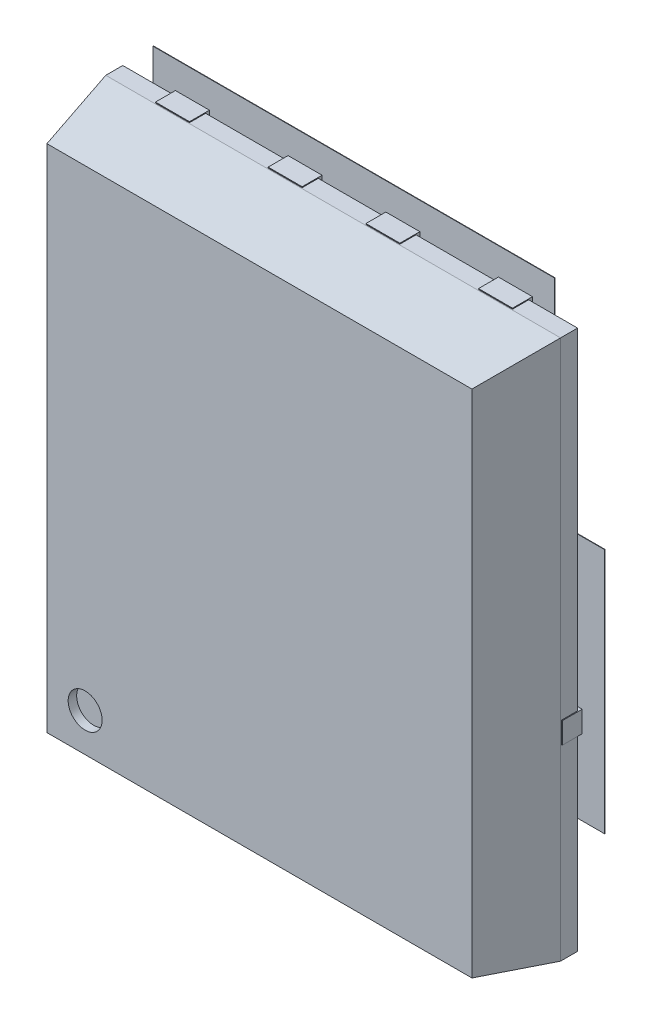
ISO-10303-21;
HEADER;
FILE_DESCRIPTION(('STEP AP214'),'2;1');
FILE_NAME('part.step','',(''),(''),'','','');
FILE_SCHEMA(('AUTOMOTIVE_DESIGN { 1 0 10303 214 1 1 1 1 }'));
ENDSEC;
DATA;
#1=APPLICATION_CONTEXT('core data for automotive mechanical design processes');
#2=APPLICATION_PROTOCOL_DEFINITION('international standard','automotive_design',2000,#1);
#3=PRODUCT_CONTEXT('',#1,'mechanical');
#4=PRODUCT('Part','Part','',(#3));
#5=PRODUCT_RELATED_PRODUCT_CATEGORY('part','',(#4));
#6=PRODUCT_DEFINITION_FORMATION('','',#4);
#7=PRODUCT_DEFINITION_CONTEXT('part definition',#1,'design');
#8=PRODUCT_DEFINITION('design','',#6,#7);
#9=PRODUCT_DEFINITION_SHAPE('','',#8);
#10=(LENGTH_UNIT() NAMED_UNIT(*) SI_UNIT(.MILLI.,.METRE.));
#11=(NAMED_UNIT(*) PLANE_ANGLE_UNIT() SI_UNIT($,.RADIAN.));
#12=(NAMED_UNIT(*) SI_UNIT($,.STERADIAN.) SOLID_ANGLE_UNIT());
#13=UNCERTAINTY_MEASURE_WITH_UNIT(LENGTH_MEASURE(1.E-05),#10,'distance_accuracy_value','');
#14=(GEOMETRIC_REPRESENTATION_CONTEXT(3) GLOBAL_UNCERTAINTY_ASSIGNED_CONTEXT((#13)) GLOBAL_UNIT_ASSIGNED_CONTEXT((#10,
#11,#12)) REPRESENTATION_CONTEXT('',''));
#15=CARTESIAN_POINT('',(0.,0.,0.));
#16=DIRECTION('',(0.,0.,1.));
#17=DIRECTION('',(1.,0.,0.));
#18=AXIS2_PLACEMENT_3D('',#15,#16,#17);
#19=CARTESIAN_POINT('',(0.,0.,0.0762));
#20=DIRECTION('',(0.,0.,1.));
#21=DIRECTION('',(1.,0.,0.));
#22=AXIS2_PLACEMENT_3D('',#19,#20,#21);
#23=PLANE('',#22);
#24=DIRECTION('',(0.,1.,0.));
#25=VECTOR('',#24,1.);
#26=CARTESIAN_POINT('',(-2.94899999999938,1.03199999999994,0.0762));
#27=LINE('',#26,#25);
#28=CARTESIAN_POINT('',(-2.94899999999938,1.03199999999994,0.0762));
#29=VERTEX_POINT('',#28);
#30=CARTESIAN_POINT('',(-2.94899999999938,-1.86299999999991,0.0762));
#31=VERTEX_POINT('',#30);
#32=EDGE_CURVE('E588',#29,#31,#27,.F.);
#33=ORIENTED_EDGE('',*,*,#32,.F.);
#34=DIRECTION('',(1.,0.,0.));
#35=VECTOR('',#34,1.);
#36=CARTESIAN_POINT('',(-2.36199999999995,1.03199999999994,0.0762));
#37=LINE('',#36,#35);
#38=CARTESIAN_POINT('',(-2.36199999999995,1.03199999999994,0.0762));
#39=VERTEX_POINT('',#38);
#40=EDGE_CURVE('E583',#39,#29,#37,.F.);
#41=ORIENTED_EDGE('',*,*,#40,.F.);
#42=DIRECTION('',(0.,1.,0.));
#43=VECTOR('',#42,1.);
#44=CARTESIAN_POINT('',(-2.36199999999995,3.50500000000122,0.0762));
#45=LINE('',#44,#43);
#46=CARTESIAN_POINT('',(-2.36199999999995,3.50500000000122,0.0762));
#47=VERTEX_POINT('',#46);
#48=EDGE_CURVE('E578',#47,#39,#45,.F.);
#49=ORIENTED_EDGE('',*,*,#48,.F.);
#50=DIRECTION('',(1.,0.,0.));
#51=VECTOR('',#50,1.);
#52=CARTESIAN_POINT('',(2.36199999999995,3.50500000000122,0.0762));
#53=LINE('',#52,#51);
#54=CARTESIAN_POINT('',(2.36199999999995,3.50500000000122,0.0762));
#55=VERTEX_POINT('',#54);
#56=EDGE_CURVE('E563',#55,#47,#53,.F.);
#57=ORIENTED_EDGE('',*,*,#56,.F.);
#58=DIRECTION('',(0.,1.,0.));
#59=VECTOR('',#58,1.);
#60=CARTESIAN_POINT('',(2.36199999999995,1.03199999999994,0.0762));
#61=LINE('',#60,#59);
#62=CARTESIAN_POINT('',(2.36199999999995,1.03199999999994,0.0762));
#63=VERTEX_POINT('',#62);
#64=EDGE_CURVE('E546',#63,#55,#61,.T.);
#65=ORIENTED_EDGE('',*,*,#64,.F.);
#66=DIRECTION('',(1.,0.,0.));
#67=VECTOR('',#66,1.);
#68=CARTESIAN_POINT('',(2.94899999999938,1.03199999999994,0.0762));
#69=LINE('',#68,#67);
#70=CARTESIAN_POINT('',(2.94899999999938,1.03199999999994,0.0762));
#71=VERTEX_POINT('',#70);
#72=EDGE_CURVE('E551',#71,#63,#69,.F.);
#73=ORIENTED_EDGE('',*,*,#72,.F.);
#74=DIRECTION('',(0.,1.,0.));
#75=VECTOR('',#74,1.);
#76=CARTESIAN_POINT('',(2.94899999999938,-1.86299999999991,0.0762));
#77=LINE('',#76,#75);
#78=CARTESIAN_POINT('',(2.94899999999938,-1.86299999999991,0.0762));
#79=VERTEX_POINT('',#78);
#80=EDGE_CURVE('E599',#79,#71,#77,.T.);
#81=ORIENTED_EDGE('',*,*,#80,.F.);
#82=DIRECTION('',(1.,0.,0.));
#83=VECTOR('',#82,1.);
#84=CARTESIAN_POINT('',(-2.94899999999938,-1.86299999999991,0.0762));
#85=LINE('',#84,#83);
#86=EDGE_CURVE('E593',#31,#79,#85,.T.);
#87=ORIENTED_EDGE('',*,*,#86,.F.);
#88=EDGE_LOOP('',(#33,#41,#49,#57,#65,#73,#81,#87));
#89=FACE_BOUND('',#88,.T.);
#90=ADVANCED_FACE('F16',(#89),#23,.F.);
#91=CARTESIAN_POINT('',(2.94899999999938,1.03199999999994,0.0762));
#92=DIRECTION('',(0.,1.,0.));
#93=DIRECTION('',(0.,0.,1.));
#94=AXIS2_PLACEMENT_3D('',#91,#92,#93);
#95=PLANE('',#94);
#96=DIRECTION('',(0.,0.,-1.));
#97=VECTOR('',#96,1.);
#98=CARTESIAN_POINT('',(2.94899999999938,1.03199999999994,0.0762));
#99=LINE('',#98,#97);
#100=CARTESIAN_POINT('',(2.94899999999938,1.03199999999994,0.081788));
#101=VERTEX_POINT('',#100);
#102=EDGE_CURVE('E556',#71,#101,#99,.F.);
#103=ORIENTED_EDGE('',*,*,#102,.F.);
#104=ORIENTED_EDGE('',*,*,#72,.T.);
#105=DIRECTION('',(0.,0.,-1.));
#106=VECTOR('',#105,1.);
#107=CARTESIAN_POINT('',(2.36199999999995,1.03199999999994,0.0762));
#108=LINE('',#107,#106);
#109=CARTESIAN_POINT('',(2.36199999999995,1.03199999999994,0.081788));
#110=VERTEX_POINT('',#109);
#111=EDGE_CURVE('E553',#110,#63,#108,.T.);
#112=ORIENTED_EDGE('',*,*,#111,.F.);
#113=DIRECTION('',(1.,0.,0.));
#114=VECTOR('',#113,1.);
#115=CARTESIAN_POINT('',(0.,1.03199999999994,0.081788));
#116=LINE('',#115,#114);
#117=EDGE_CURVE('E601',#101,#110,#116,.F.);
#118=ORIENTED_EDGE('',*,*,#117,.F.);
#119=EDGE_LOOP('',(#103,#104,#112,#118));
#120=FACE_BOUND('',#119,.T.);
#121=ADVANCED_FACE('F552',(#120),#95,.T.);
#122=CARTESIAN_POINT('',(2.36199999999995,1.03199999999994,0.0762));
#123=DIRECTION('',(1.,0.,0.));
#124=DIRECTION('',(0.,0.,-1.));
#125=AXIS2_PLACEMENT_3D('',#122,#123,#124);
#126=PLANE('',#125);
#127=ORIENTED_EDGE('',*,*,#111,.T.);
#128=ORIENTED_EDGE('',*,*,#64,.T.);
#129=DIRECTION('',(0.,0.,1.));
#130=VECTOR('',#129,1.);
#131=CARTESIAN_POINT('',(2.36199999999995,3.50500000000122,0.0762));
#132=LINE('',#131,#130);
#133=CARTESIAN_POINT('',(2.36199999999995,3.50500000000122,0.081788));
#134=VERTEX_POINT('',#133);
#135=EDGE_CURVE('E565',#134,#55,#132,.F.);
#136=ORIENTED_EDGE('',*,*,#135,.F.);
#137=DIRECTION('',(0.,1.,0.));
#138=VECTOR('',#137,1.);
#139=CARTESIAN_POINT('',(2.36199999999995,0.,0.081788));
#140=LINE('',#139,#138);
#141=EDGE_CURVE('E569',#110,#134,#140,.T.);
#142=ORIENTED_EDGE('',*,*,#141,.F.);
#143=EDGE_LOOP('',(#127,#128,#136,#142));
#144=FACE_BOUND('',#143,.T.);
#145=ADVANCED_FACE('F567',(#144),#126,.T.);
#146=CARTESIAN_POINT('',(2.36199999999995,3.50500000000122,0.0762));
#147=DIRECTION('',(0.,1.,0.));
#148=DIRECTION('',(0.,0.,1.));
#149=AXIS2_PLACEMENT_3D('',#146,#147,#148);
#150=PLANE('',#149);
#151=ORIENTED_EDGE('',*,*,#135,.T.);
#152=ORIENTED_EDGE('',*,*,#56,.T.);
#153=DIRECTION('',(0.,0.,1.));
#154=VECTOR('',#153,1.);
#155=CARTESIAN_POINT('',(-2.36199999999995,3.50500000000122,0.0762));
#156=LINE('',#155,#154);
#157=CARTESIAN_POINT('',(-2.36199999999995,3.50500000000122,0.081788));
#158=VERTEX_POINT('',#157);
#159=EDGE_CURVE('E575',#158,#47,#156,.F.);
#160=ORIENTED_EDGE('',*,*,#159,.F.);
#161=DIRECTION('',(1.,0.,0.));
#162=VECTOR('',#161,1.);
#163=CARTESIAN_POINT('',(0.,3.50500000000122,0.081788));
#164=LINE('',#163,#162);
#165=EDGE_CURVE('E604',#134,#158,#164,.F.);
#166=ORIENTED_EDGE('',*,*,#165,.F.);
#167=EDGE_LOOP('',(#151,#152,#160,#166));
#168=FACE_BOUND('',#167,.T.);
#169=ADVANCED_FACE('F2326',(#168),#150,.T.);
#170=CARTESIAN_POINT('',(-2.36199999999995,3.50500000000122,0.0762));
#171=DIRECTION('',(-1.,0.,0.));
#172=DIRECTION('',(0.,0.,1.));
#173=AXIS2_PLACEMENT_3D('',#170,#171,#172);
#174=PLANE('',#173);
#175=ORIENTED_EDGE('',*,*,#159,.T.);
#176=ORIENTED_EDGE('',*,*,#48,.T.);
#177=DIRECTION('',(0.,0.,1.));
#178=VECTOR('',#177,1.);
#179=CARTESIAN_POINT('',(-2.36199999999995,1.03199999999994,0.0762));
#180=LINE('',#179,#178);
#181=CARTESIAN_POINT('',(-2.36199999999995,1.03199999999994,0.081788));
#182=VERTEX_POINT('',#181);
#183=EDGE_CURVE('E580',#182,#39,#180,.F.);
#184=ORIENTED_EDGE('',*,*,#183,.F.);
#185=DIRECTION('',(0.,1.,0.));
#186=VECTOR('',#185,1.);
#187=CARTESIAN_POINT('',(-2.36199999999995,0.,0.081788));
#188=LINE('',#187,#186);
#189=EDGE_CURVE('E607',#158,#182,#188,.F.);
#190=ORIENTED_EDGE('',*,*,#189,.F.);
#191=EDGE_LOOP('',(#175,#176,#184,#190));
#192=FACE_BOUND('',#191,.T.);
#193=ADVANCED_FACE('F2317',(#192),#174,.T.);
#194=CARTESIAN_POINT('',(-2.36199999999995,1.03199999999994,0.0762));
#195=DIRECTION('',(0.,1.,0.));
#196=DIRECTION('',(0.,0.,1.));
#197=AXIS2_PLACEMENT_3D('',#194,#195,#196);
#198=PLANE('',#197);
#199=ORIENTED_EDGE('',*,*,#183,.T.);
#200=ORIENTED_EDGE('',*,*,#40,.T.);
#201=DIRECTION('',(0.,0.,1.));
#202=VECTOR('',#201,1.);
#203=CARTESIAN_POINT('',(-2.94899999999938,1.03199999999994,0.0762));
#204=LINE('',#203,#202);
#205=CARTESIAN_POINT('',(-2.94899999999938,1.03199999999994,0.081788));
#206=VERTEX_POINT('',#205);
#207=EDGE_CURVE('E585',#206,#29,#204,.F.);
#208=ORIENTED_EDGE('',*,*,#207,.F.);
#209=DIRECTION('',(1.,0.,0.));
#210=VECTOR('',#209,1.);
#211=CARTESIAN_POINT('',(0.,1.03199999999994,0.081788));
#212=LINE('',#211,#210);
#213=EDGE_CURVE('E610',#182,#206,#212,.F.);
#214=ORIENTED_EDGE('',*,*,#213,.F.);
#215=EDGE_LOOP('',(#199,#200,#208,#214));
#216=FACE_BOUND('',#215,.T.);
#217=ADVANCED_FACE('F2308',(#216),#198,.T.);
#218=CARTESIAN_POINT('',(-2.94899999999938,1.03199999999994,0.0762));
#219=DIRECTION('',(-1.,0.,0.));
#220=DIRECTION('',(0.,0.,1.));
#221=AXIS2_PLACEMENT_3D('',#218,#219,#220);
#222=PLANE('',#221);
#223=ORIENTED_EDGE('',*,*,#207,.T.);
#224=ORIENTED_EDGE('',*,*,#32,.T.);
#225=DIRECTION('',(0.,0.,-1.));
#226=VECTOR('',#225,1.);
#227=CARTESIAN_POINT('',(-2.94899999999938,-1.86299999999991,0.0762));
#228=LINE('',#227,#226);
#229=CARTESIAN_POINT('',(-2.94899999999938,-1.86299999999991,0.081788));
#230=VERTEX_POINT('',#229);
#231=EDGE_CURVE('E590',#230,#31,#228,.T.);
#232=ORIENTED_EDGE('',*,*,#231,.F.);
#233=DIRECTION('',(0.,1.,0.));
#234=VECTOR('',#233,1.);
#235=CARTESIAN_POINT('',(-2.94899999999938,0.,0.081788));
#236=LINE('',#235,#234);
#237=EDGE_CURVE('E613',#206,#230,#236,.F.);
#238=ORIENTED_EDGE('',*,*,#237,.F.);
#239=EDGE_LOOP('',(#223,#224,#232,#238));
#240=FACE_BOUND('',#239,.T.);
#241=ADVANCED_FACE('F2299',(#240),#222,.T.);
#242=CARTESIAN_POINT('',(-2.94899999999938,-1.86299999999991,0.0762));
#243=DIRECTION('',(0.,-1.,0.));
#244=DIRECTION('',(0.,0.,-1.));
#245=AXIS2_PLACEMENT_3D('',#242,#243,#244);
#246=PLANE('',#245);
#247=ORIENTED_EDGE('',*,*,#231,.T.);
#248=ORIENTED_EDGE('',*,*,#86,.T.);
#249=DIRECTION('',(0.,0.,-1.));
#250=VECTOR('',#249,1.);
#251=CARTESIAN_POINT('',(2.94899999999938,-1.86299999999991,0.0762));
#252=LINE('',#251,#250);
#253=CARTESIAN_POINT('',(2.94899999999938,-1.86299999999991,0.081788));
#254=VERTEX_POINT('',#253);
#255=EDGE_CURVE('E596',#254,#79,#252,.T.);
#256=ORIENTED_EDGE('',*,*,#255,.F.);
#257=DIRECTION('',(1.,0.,0.));
#258=VECTOR('',#257,1.);
#259=CARTESIAN_POINT('',(0.,-1.86299999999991,0.081788));
#260=LINE('',#259,#258);
#261=EDGE_CURVE('E616',#230,#254,#260,.T.);
#262=ORIENTED_EDGE('',*,*,#261,.F.);
#263=EDGE_LOOP('',(#247,#248,#256,#262));
#264=FACE_BOUND('',#263,.T.);
#265=ADVANCED_FACE('F2290',(#264),#246,.T.);
#266=CARTESIAN_POINT('',(2.94899999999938,-1.86299999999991,0.0762));
#267=DIRECTION('',(1.,0.,0.));
#268=DIRECTION('',(0.,0.,-1.));
#269=AXIS2_PLACEMENT_3D('',#266,#267,#268);
#270=PLANE('',#269);
#271=ORIENTED_EDGE('',*,*,#255,.T.);
#272=ORIENTED_EDGE('',*,*,#80,.T.);
#273=ORIENTED_EDGE('',*,*,#102,.T.);
#274=DIRECTION('',(0.,1.,0.));
#275=VECTOR('',#274,1.);
#276=CARTESIAN_POINT('',(2.94899999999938,0.,0.081788));
#277=LINE('',#276,#275);
#278=EDGE_CURVE('E619',#254,#101,#277,.T.);
#279=ORIENTED_EDGE('',*,*,#278,.F.);
#280=EDGE_LOOP('',(#271,#272,#273,#279));
#281=FACE_BOUND('',#280,.T.);
#282=ADVANCED_FACE('F2279',(#281),#270,.T.);
#283=CARTESIAN_POINT('',(0.,0.,0.0762));
#284=DIRECTION('',(0.,0.,1.));
#285=DIRECTION('',(1.,0.,0.));
#286=AXIS2_PLACEMENT_3D('',#283,#284,#285);
#287=PLANE('',#286);
#288=DIRECTION('',(0.,1.,0.));
#289=VECTOR('',#288,1.);
#290=CARTESIAN_POINT('',(-0.990500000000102,-2.15350000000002,0.0762));
#291=LINE('',#290,#289);
#292=CARTESIAN_POINT('',(-0.990500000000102,-2.15350000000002,0.0762));
#293=VERTEX_POINT('',#292);
#294=CARTESIAN_POINT('',(-0.990500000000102,-3.29649999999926,0.0762));
#295=VERTEX_POINT('',#294);
#296=EDGE_CURVE('E647',#293,#295,#291,.F.);
#297=ORIENTED_EDGE('',*,*,#296,.F.);
#298=DIRECTION('',(1.,0.,0.));
#299=VECTOR('',#298,1.);
#300=CARTESIAN_POINT('',(-0.279499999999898,-2.15350000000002,0.0762));
#301=LINE('',#300,#299);
#302=CARTESIAN_POINT('',(-0.279499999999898,-2.15350000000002,0.0762));
#303=VERTEX_POINT('',#302);
#304=EDGE_CURVE('E642',#303,#293,#301,.F.);
#305=ORIENTED_EDGE('',*,*,#304,.F.);
#306=DIRECTION('',(0.,1.,0.));
#307=VECTOR('',#306,1.);
#308=CARTESIAN_POINT('',(-0.279499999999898,-3.29649999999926,0.0762));
#309=LINE('',#308,#307);
#310=CARTESIAN_POINT('',(-0.279499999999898,-3.29649999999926,0.0762));
#311=VERTEX_POINT('',#310);
#312=EDGE_CURVE('E660',#311,#303,#309,.T.);
#313=ORIENTED_EDGE('',*,*,#312,.F.);
#314=DIRECTION('',(1.,0.,0.));
#315=VECTOR('',#314,1.);
#316=CARTESIAN_POINT('',(-0.990500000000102,-3.29649999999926,0.0762));
#317=LINE('',#316,#315);
#318=EDGE_CURVE('E652',#295,#311,#317,.T.);
#319=ORIENTED_EDGE('',*,*,#318,.F.);
#320=EDGE_LOOP('',(#297,#305,#313,#319));
#321=FACE_BOUND('',#320,.T.);
#322=ADVANCED_FACE('F2269',(#321),#287,.F.);
#323=CARTESIAN_POINT('',(0.,0.,0.0762));
#324=DIRECTION('',(0.,0.,1.));
#325=DIRECTION('',(1.,0.,0.));
#326=AXIS2_PLACEMENT_3D('',#323,#324,#325);
#327=PLANE('',#326);
#328=DIRECTION('',(0.,1.,0.));
#329=VECTOR('',#328,1.);
#330=CARTESIAN_POINT('',(0.279499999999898,-2.15350000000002,0.0762));
#331=LINE('',#330,#329);
#332=CARTESIAN_POINT('',(0.279499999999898,-2.15350000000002,0.0762));
#333=VERTEX_POINT('',#332);
#334=CARTESIAN_POINT('',(0.279499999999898,-3.29649999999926,0.0762));
#335=VERTEX_POINT('',#334);
#336=EDGE_CURVE('E668',#333,#335,#331,.F.);
#337=ORIENTED_EDGE('',*,*,#336,.F.);
#338=DIRECTION('',(1.,0.,0.));
#339=VECTOR('',#338,1.);
#340=CARTESIAN_POINT('',(0.990500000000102,-2.15350000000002,0.0762));
#341=LINE('',#340,#339);
#342=CARTESIAN_POINT('',(0.990500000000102,-2.15350000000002,0.0762));
#343=VERTEX_POINT('',#342);
#344=EDGE_CURVE('E663',#343,#333,#341,.F.);
#345=ORIENTED_EDGE('',*,*,#344,.F.);
#346=DIRECTION('',(0.,1.,0.));
#347=VECTOR('',#346,1.);
#348=CARTESIAN_POINT('',(0.990500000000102,-3.29649999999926,0.0762));
#349=LINE('',#348,#347);
#350=CARTESIAN_POINT('',(0.990500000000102,-3.29649999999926,0.0762));
#351=VERTEX_POINT('',#350);
#352=EDGE_CURVE('E681',#351,#343,#349,.T.);
#353=ORIENTED_EDGE('',*,*,#352,.F.);
#354=DIRECTION('',(1.,0.,0.));
#355=VECTOR('',#354,1.);
#356=CARTESIAN_POINT('',(0.279499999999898,-3.29649999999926,0.0762));
#357=LINE('',#356,#355);
#358=EDGE_CURVE('E673',#335,#351,#357,.T.);
#359=ORIENTED_EDGE('',*,*,#358,.F.);
#360=EDGE_LOOP('',(#337,#345,#353,#359));
#361=FACE_BOUND('',#360,.T.);
#362=ADVANCED_FACE('F2259',(#361),#327,.F.);
#363=CARTESIAN_POINT('',(0.,0.,0.0762));
#364=DIRECTION('',(0.,0.,1.));
#365=DIRECTION('',(1.,0.,0.));
#366=AXIS2_PLACEMENT_3D('',#363,#364,#365);
#367=PLANE('',#366);
#368=DIRECTION('',(0.,1.,0.));
#369=VECTOR('',#368,1.);
#370=CARTESIAN_POINT('',(2.2605000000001,-3.29649999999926,0.0762));
#371=LINE('',#370,#369);
#372=CARTESIAN_POINT('',(2.2605000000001,-3.29649999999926,0.0762));
#373=VERTEX_POINT('',#372);
#374=CARTESIAN_POINT('',(2.2605000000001,-2.15350000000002,0.0762));
#375=VERTEX_POINT('',#374);
#376=EDGE_CURVE('E689',#373,#375,#371,.T.);
#377=ORIENTED_EDGE('',*,*,#376,.F.);
#378=DIRECTION('',(1.,0.,0.));
#379=VECTOR('',#378,1.);
#380=CARTESIAN_POINT('',(1.5494999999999,-3.29649999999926,0.0762));
#381=LINE('',#380,#379);
#382=CARTESIAN_POINT('',(1.5494999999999,-3.29649999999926,0.0762));
#383=VERTEX_POINT('',#382);
#384=EDGE_CURVE('E684',#383,#373,#381,.T.);
#385=ORIENTED_EDGE('',*,*,#384,.F.);
#386=DIRECTION('',(0.,1.,0.));
#387=VECTOR('',#386,1.);
#388=CARTESIAN_POINT('',(1.5494999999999,-2.15350000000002,0.0762));
#389=LINE('',#388,#387);
#390=CARTESIAN_POINT('',(1.5494999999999,-2.15350000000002,0.0762));
#391=VERTEX_POINT('',#390);
#392=EDGE_CURVE('E702',#391,#383,#389,.F.);
#393=ORIENTED_EDGE('',*,*,#392,.F.);
#394=DIRECTION('',(1.,0.,0.));
#395=VECTOR('',#394,1.);
#396=CARTESIAN_POINT('',(2.2605000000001,-2.15350000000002,0.0762));
#397=LINE('',#396,#395);
#398=EDGE_CURVE('E694',#375,#391,#397,.F.);
#399=ORIENTED_EDGE('',*,*,#398,.F.);
#400=EDGE_LOOP('',(#377,#385,#393,#399));
#401=FACE_BOUND('',#400,.T.);
#402=ADVANCED_FACE('F2249',(#401),#367,.F.);
#403=CARTESIAN_POINT('',(0.,0.,0.0762));
#404=DIRECTION('',(0.,0.,1.));
#405=DIRECTION('',(1.,0.,0.));
#406=AXIS2_PLACEMENT_3D('',#403,#404,#405);
#407=PLANE('',#406);
#408=DIRECTION('',(0.,1.,0.));
#409=VECTOR('',#408,1.);
#410=CARTESIAN_POINT('',(-2.2605000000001,-2.15350000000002,0.0762));
#411=LINE('',#410,#409);
#412=CARTESIAN_POINT('',(-2.2605000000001,-2.15350000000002,0.0762));
#413=VERTEX_POINT('',#412);
#414=CARTESIAN_POINT('',(-2.2605000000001,-3.29649999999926,0.0762));
#415=VERTEX_POINT('',#414);
#416=EDGE_CURVE('E710',#413,#415,#411,.F.);
#417=ORIENTED_EDGE('',*,*,#416,.F.);
#418=DIRECTION('',(1.,0.,0.));
#419=VECTOR('',#418,1.);
#420=CARTESIAN_POINT('',(-1.5494999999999,-2.15350000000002,0.0762));
#421=LINE('',#420,#419);
#422=CARTESIAN_POINT('',(-1.5494999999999,-2.15350000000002,0.0762));
#423=VERTEX_POINT('',#422);
#424=EDGE_CURVE('E705',#423,#413,#421,.F.);
#425=ORIENTED_EDGE('',*,*,#424,.F.);
#426=DIRECTION('',(0.,1.,0.));
#427=VECTOR('',#426,1.);
#428=CARTESIAN_POINT('',(-1.5494999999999,-3.29649999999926,0.0762));
#429=LINE('',#428,#427);
#430=CARTESIAN_POINT('',(-1.5494999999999,-3.29649999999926,0.0762));
#431=VERTEX_POINT('',#430);
#432=EDGE_CURVE('E723',#431,#423,#429,.T.);
#433=ORIENTED_EDGE('',*,*,#432,.F.);
#434=DIRECTION('',(1.,0.,0.));
#435=VECTOR('',#434,1.);
#436=CARTESIAN_POINT('',(-2.2605000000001,-3.29649999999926,0.0762));
#437=LINE('',#436,#435);
#438=EDGE_CURVE('E715',#415,#431,#437,.T.);
#439=ORIENTED_EDGE('',*,*,#438,.F.);
#440=EDGE_LOOP('',(#417,#425,#433,#439));
#441=FACE_BOUND('',#440,.T.);
#442=ADVANCED_FACE('F2241',(#441),#407,.F.);
#443=CARTESIAN_POINT('',(0.,0.,0.081788));
#444=DIRECTION('',(0.,0.,1.));
#445=DIRECTION('',(1.,0.,0.));
#446=AXIS2_PLACEMENT_3D('',#443,#444,#445);
#447=PLANE('',#446);
#448=DIRECTION('',(0.,1.,0.));
#449=VECTOR('',#448,1.);
#450=CARTESIAN_POINT('',(1.70000000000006,0.,0.081788));
#451=LINE('',#450,#449);
#452=CARTESIAN_POINT('',(1.70000000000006,2.62499999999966,0.081788));
#453=VERTEX_POINT('',#452);
#454=CARTESIAN_POINT('',(1.70000000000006,3.18499999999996,0.081788));
#455=VERTEX_POINT('',#454);
#456=EDGE_CURVE('E640',#453,#455,#451,.T.);
#457=ORIENTED_EDGE('',*,*,#456,.T.);
#458=DIRECTION('',(1.,0.,0.));
#459=VECTOR('',#458,1.);
#460=CARTESIAN_POINT('',(2.09999999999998,3.18499999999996,0.081788));
#461=LINE('',#460,#459);
#462=CARTESIAN_POINT('',(2.09999999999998,3.18499999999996,0.081788));
#463=VERTEX_POINT('',#462);
#464=EDGE_CURVE('E757',#463,#455,#461,.F.);
#465=ORIENTED_EDGE('',*,*,#464,.F.);
#466=DIRECTION('',(0.,1.,0.));
#467=VECTOR('',#466,1.);
#468=CARTESIAN_POINT('',(2.09999999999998,-0.724999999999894,0.081788));
#469=LINE('',#468,#467);
#470=CARTESIAN_POINT('',(2.09999999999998,-0.724999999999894,0.081788));
#471=VERTEX_POINT('',#470);
#472=EDGE_CURVE('E732',#471,#463,#469,.T.);
#473=ORIENTED_EDGE('',*,*,#472,.F.);
#474=DIRECTION('',(1.,0.,0.));
#475=VECTOR('',#474,1.);
#476=CARTESIAN_POINT('',(0.,-0.724999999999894,0.081788));
#477=LINE('',#476,#475);
#478=CARTESIAN_POINT('',(2.68499999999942,-0.724999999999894,0.081788));
#479=VERTEX_POINT('',#478);
#480=EDGE_CURVE('E622',#471,#479,#477,.T.);
#481=ORIENTED_EDGE('',*,*,#480,.T.);
#482=DIRECTION('',(0.,1.,0.));
#483=VECTOR('',#482,1.);
#484=CARTESIAN_POINT('',(2.68499999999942,-0.97499999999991,0.081788));
#485=LINE('',#484,#483);
#486=CARTESIAN_POINT('',(2.68499999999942,-0.97499999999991,0.081788));
#487=VERTEX_POINT('',#486);
#488=EDGE_CURVE('E734',#487,#479,#485,.T.);
#489=ORIENTED_EDGE('',*,*,#488,.F.);
#490=DIRECTION('',(1.,0.,0.));
#491=VECTOR('',#490,1.);
#492=CARTESIAN_POINT('',(-2.68499999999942,-0.97499999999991,0.081788));
#493=LINE('',#492,#491);
#494=CARTESIAN_POINT('',(-2.68499999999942,-0.97499999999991,0.081788));
#495=VERTEX_POINT('',#494);
#496=EDGE_CURVE('E769',#495,#487,#493,.T.);
#497=ORIENTED_EDGE('',*,*,#496,.F.);
#498=DIRECTION('',(0.,1.,0.));
#499=VECTOR('',#498,1.);
#500=CARTESIAN_POINT('',(-2.68499999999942,0.,0.081788));
#501=LINE('',#500,#499);
#502=CARTESIAN_POINT('',(-2.68499999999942,-0.724999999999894,0.081788));
#503=VERTEX_POINT('',#502);
#504=EDGE_CURVE('E624',#495,#503,#501,.T.);
#505=ORIENTED_EDGE('',*,*,#504,.T.);
#506=DIRECTION('',(1.,0.,0.));
#507=VECTOR('',#506,1.);
#508=CARTESIAN_POINT('',(0.,-0.724999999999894,0.081788));
#509=LINE('',#508,#507);
#510=CARTESIAN_POINT('',(-2.09999999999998,-0.724999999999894,0.081788));
#511=VERTEX_POINT('',#510);
#512=EDGE_CURVE('E627',#503,#511,#509,.T.);
#513=ORIENTED_EDGE('',*,*,#512,.T.);
#514=DIRECTION('',(0.,1.,0.));
#515=VECTOR('',#514,1.);
#516=CARTESIAN_POINT('',(-2.09999999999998,3.18499999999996,0.081788));
#517=LINE('',#516,#515);
#518=CARTESIAN_POINT('',(-2.09999999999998,3.18499999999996,0.081788));
#519=VERTEX_POINT('',#518);
#520=EDGE_CURVE('E779',#519,#511,#517,.F.);
#521=ORIENTED_EDGE('',*,*,#520,.F.);
#522=DIRECTION('',(1.,0.,0.));
#523=VECTOR('',#522,1.);
#524=CARTESIAN_POINT('',(-1.70000000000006,3.18499999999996,0.081788));
#525=LINE('',#524,#523);
#526=CARTESIAN_POINT('',(-1.70000000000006,3.18499999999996,0.081788));
#527=VERTEX_POINT('',#526);
#528=EDGE_CURVE('E752',#527,#519,#525,.F.);
#529=ORIENTED_EDGE('',*,*,#528,.F.);
#530=DIRECTION('',(0.,1.,0.));
#531=VECTOR('',#530,1.);
#532=CARTESIAN_POINT('',(-1.70000000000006,0.,0.081788));
#533=LINE('',#532,#531);
#534=CARTESIAN_POINT('',(-1.70000000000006,2.62499999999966,0.081788));
#535=VERTEX_POINT('',#534);
#536=EDGE_CURVE('E630',#527,#535,#533,.F.);
#537=ORIENTED_EDGE('',*,*,#536,.T.);
#538=DIRECTION('',(1.,0.,0.));
#539=VECTOR('',#538,1.);
#540=CARTESIAN_POINT('',(-0.774999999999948,2.62499999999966,0.081788));
#541=LINE('',#540,#539);
#542=CARTESIAN_POINT('',(-0.774999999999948,2.62499999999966,0.081788));
#543=VERTEX_POINT('',#542);
#544=EDGE_CURVE('E749',#543,#535,#541,.F.);
#545=ORIENTED_EDGE('',*,*,#544,.F.);
#546=DIRECTION('',(0.,1.,0.));
#547=VECTOR('',#546,1.);
#548=CARTESIAN_POINT('',(-0.774999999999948,0.,0.081788));
#549=LINE('',#548,#547);
#550=CARTESIAN_POINT('',(-0.774999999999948,3.18499999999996,0.081788));
#551=VERTEX_POINT('',#550);
#552=EDGE_CURVE('E632',#543,#551,#549,.T.);
#553=ORIENTED_EDGE('',*,*,#552,.T.);
#554=DIRECTION('',(1.,0.,0.));
#555=VECTOR('',#554,1.);
#556=CARTESIAN_POINT('',(-0.375000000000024,3.18499999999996,0.081788));
#557=LINE('',#556,#555);
#558=CARTESIAN_POINT('',(-0.375000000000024,3.18499999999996,0.081788));
#559=VERTEX_POINT('',#558);
#560=EDGE_CURVE('E746',#559,#551,#557,.F.);
#561=ORIENTED_EDGE('',*,*,#560,.F.);
#562=DIRECTION('',(0.,1.,0.));
#563=VECTOR('',#562,1.);
#564=CARTESIAN_POINT('',(-0.375000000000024,0.,0.081788));
#565=LINE('',#564,#563);
#566=CARTESIAN_POINT('',(-0.375000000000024,2.62499999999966,0.081788));
#567=VERTEX_POINT('',#566);
#568=EDGE_CURVE('E634',#559,#567,#565,.F.);
#569=ORIENTED_EDGE('',*,*,#568,.T.);
#570=DIRECTION('',(1.,0.,0.));
#571=VECTOR('',#570,1.);
#572=CARTESIAN_POINT('',(0.375000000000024,2.62499999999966,0.081788));
#573=LINE('',#572,#571);
#574=CARTESIAN_POINT('',(0.375000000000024,2.62499999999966,0.081788));
#575=VERTEX_POINT('',#574);
#576=EDGE_CURVE('E743',#575,#567,#573,.F.);
#577=ORIENTED_EDGE('',*,*,#576,.F.);
#578=DIRECTION('',(0.,1.,0.));
#579=VECTOR('',#578,1.);
#580=CARTESIAN_POINT('',(0.375000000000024,0.,0.081788));
#581=LINE('',#580,#579);
#582=CARTESIAN_POINT('',(0.375000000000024,3.18499999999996,0.081788));
#583=VERTEX_POINT('',#582);
#584=EDGE_CURVE('E636',#575,#583,#581,.T.);
#585=ORIENTED_EDGE('',*,*,#584,.T.);
#586=DIRECTION('',(1.,0.,0.));
#587=VECTOR('',#586,1.);
#588=CARTESIAN_POINT('',(0.774999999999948,3.18499999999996,0.081788));
#589=LINE('',#588,#587);
#590=CARTESIAN_POINT('',(0.774999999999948,3.18499999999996,0.081788));
#591=VERTEX_POINT('',#590);
#592=EDGE_CURVE('E740',#591,#583,#589,.F.);
#593=ORIENTED_EDGE('',*,*,#592,.F.);
#594=DIRECTION('',(0.,1.,0.));
#595=VECTOR('',#594,1.);
#596=CARTESIAN_POINT('',(0.774999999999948,0.,0.081788));
#597=LINE('',#596,#595);
#598=CARTESIAN_POINT('',(0.774999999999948,2.62499999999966,0.081788));
#599=VERTEX_POINT('',#598);
#600=EDGE_CURVE('E638',#591,#599,#597,.F.);
#601=ORIENTED_EDGE('',*,*,#600,.T.);
#602=DIRECTION('',(1.,0.,0.));
#603=VECTOR('',#602,1.);
#604=CARTESIAN_POINT('',(1.70000000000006,2.62499999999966,0.081788));
#605=LINE('',#604,#603);
#606=EDGE_CURVE('E737',#453,#599,#605,.F.);
#607=ORIENTED_EDGE('',*,*,#606,.F.);
#608=EDGE_LOOP('',(#457,#465,#473,#481,#489,#497,#505,#513,#521,#529,#537,#545,#553,#561,#569,
#577,#585,#593,#601,#607));
#609=FACE_BOUND('',#608,.T.);
#610=ORIENTED_EDGE('',*,*,#261,.T.);
#611=ORIENTED_EDGE('',*,*,#278,.T.);
#612=ORIENTED_EDGE('',*,*,#117,.T.);
#613=ORIENTED_EDGE('',*,*,#141,.T.);
#614=ORIENTED_EDGE('',*,*,#165,.T.);
#615=ORIENTED_EDGE('',*,*,#189,.T.);
#616=ORIENTED_EDGE('',*,*,#213,.T.);
#617=ORIENTED_EDGE('',*,*,#237,.T.);
#618=EDGE_LOOP('',(#610,#611,#612,#613,#614,#615,#616,#617));
#619=FACE_BOUND('',#618,.T.);
#620=ADVANCED_FACE('F1442',(#609,#619),#447,.T.);
#621=CARTESIAN_POINT('',(-0.279499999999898,-2.15350000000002,0.0762));
#622=DIRECTION('',(0.,1.,0.));
#623=DIRECTION('',(0.,0.,1.));
#624=AXIS2_PLACEMENT_3D('',#621,#622,#623);
#625=PLANE('',#624);
#626=DIRECTION('',(0.,0.,-1.));
#627=VECTOR('',#626,1.);
#628=CARTESIAN_POINT('',(-0.279499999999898,-2.15350000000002,0.0762));
#629=LINE('',#628,#627);
#630=CARTESIAN_POINT('',(-0.279499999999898,-2.15350000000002,0.081788));
#631=VERTEX_POINT('',#630);
#632=EDGE_CURVE('E654',#303,#631,#629,.F.);
#633=ORIENTED_EDGE('',*,*,#632,.F.);
#634=ORIENTED_EDGE('',*,*,#304,.T.);
#635=DIRECTION('',(0.,0.,1.));
#636=VECTOR('',#635,1.);
#637=CARTESIAN_POINT('',(-0.990500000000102,-2.15350000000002,0.0762));
#638=LINE('',#637,#636);
#639=CARTESIAN_POINT('',(-0.990500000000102,-2.15350000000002,0.081788));
#640=VERTEX_POINT('',#639);
#641=EDGE_CURVE('E644',#640,#293,#638,.F.);
#642=ORIENTED_EDGE('',*,*,#641,.F.);
#643=DIRECTION('',(1.,0.,0.));
#644=VECTOR('',#643,1.);
#645=CARTESIAN_POINT('',(0.,-2.15350000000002,0.081788));
#646=LINE('',#645,#644);
#647=EDGE_CURVE('E785',#631,#640,#646,.F.);
#648=ORIENTED_EDGE('',*,*,#647,.F.);
#649=EDGE_LOOP('',(#633,#634,#642,#648));
#650=FACE_BOUND('',#649,.T.);
#651=ADVANCED_FACE('F2224',(#650),#625,.T.);
#652=CARTESIAN_POINT('',(-0.990500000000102,-2.15350000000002,0.0762));
#653=DIRECTION('',(-1.,0.,0.));
#654=DIRECTION('',(0.,0.,1.));
#655=AXIS2_PLACEMENT_3D('',#652,#653,#654);
#656=PLANE('',#655);
#657=ORIENTED_EDGE('',*,*,#641,.T.);
#658=ORIENTED_EDGE('',*,*,#296,.T.);
#659=DIRECTION('',(0.,0.,-1.));
#660=VECTOR('',#659,1.);
#661=CARTESIAN_POINT('',(-0.990500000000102,-3.29649999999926,0.0762));
#662=LINE('',#661,#660);
#663=CARTESIAN_POINT('',(-0.990500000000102,-3.29649999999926,0.081788));
#664=VERTEX_POINT('',#663);
#665=EDGE_CURVE('E649',#664,#295,#662,.T.);
#666=ORIENTED_EDGE('',*,*,#665,.F.);
#667=DIRECTION('',(0.,1.,0.));
#668=VECTOR('',#667,1.);
#669=CARTESIAN_POINT('',(-0.990500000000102,0.,0.081788));
#670=LINE('',#669,#668);
#671=EDGE_CURVE('E788',#640,#664,#670,.F.);
#672=ORIENTED_EDGE('',*,*,#671,.F.);
#673=EDGE_LOOP('',(#657,#658,#666,#672));
#674=FACE_BOUND('',#673,.T.);
#675=ADVANCED_FACE('F2215',(#674),#656,.T.);
#676=CARTESIAN_POINT('',(-0.990500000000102,-3.29649999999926,0.0762));
#677=DIRECTION('',(0.,-1.,0.));
#678=DIRECTION('',(0.,0.,-1.));
#679=AXIS2_PLACEMENT_3D('',#676,#677,#678);
#680=PLANE('',#679);
#681=ORIENTED_EDGE('',*,*,#665,.T.);
#682=ORIENTED_EDGE('',*,*,#318,.T.);
#683=DIRECTION('',(0.,0.,-1.));
#684=VECTOR('',#683,1.);
#685=CARTESIAN_POINT('',(-0.279499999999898,-3.29649999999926,0.0762));
#686=LINE('',#685,#684);
#687=CARTESIAN_POINT('',(-0.279499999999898,-3.29649999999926,0.081788));
#688=VERTEX_POINT('',#687);
#689=EDGE_CURVE('E657',#688,#311,#686,.T.);
#690=ORIENTED_EDGE('',*,*,#689,.F.);
#691=DIRECTION('',(1.,0.,0.));
#692=VECTOR('',#691,1.);
#693=CARTESIAN_POINT('',(0.,-3.29649999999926,0.081788));
#694=LINE('',#693,#692);
#695=EDGE_CURVE('E791',#664,#688,#694,.T.);
#696=ORIENTED_EDGE('',*,*,#695,.F.);
#697=EDGE_LOOP('',(#681,#682,#690,#696));
#698=FACE_BOUND('',#697,.T.);
#699=ADVANCED_FACE('F2206',(#698),#680,.T.);
#700=CARTESIAN_POINT('',(-0.279499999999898,-3.29649999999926,0.0762));
#701=DIRECTION('',(1.,0.,0.));
#702=DIRECTION('',(0.,0.,-1.));
#703=AXIS2_PLACEMENT_3D('',#700,#701,#702);
#704=PLANE('',#703);
#705=ORIENTED_EDGE('',*,*,#689,.T.);
#706=ORIENTED_EDGE('',*,*,#312,.T.);
#707=ORIENTED_EDGE('',*,*,#632,.T.);
#708=DIRECTION('',(0.,1.,0.));
#709=VECTOR('',#708,1.);
#710=CARTESIAN_POINT('',(-0.279499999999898,0.,0.081788));
#711=LINE('',#710,#709);
#712=EDGE_CURVE('E794',#688,#631,#711,.T.);
#713=ORIENTED_EDGE('',*,*,#712,.F.);
#714=EDGE_LOOP('',(#705,#706,#707,#713));
#715=FACE_BOUND('',#714,.T.);
#716=ADVANCED_FACE('F2197',(#715),#704,.T.);
#717=CARTESIAN_POINT('',(0.990500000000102,-2.15350000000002,0.0762));
#718=DIRECTION('',(0.,1.,0.));
#719=DIRECTION('',(0.,0.,1.));
#720=AXIS2_PLACEMENT_3D('',#717,#718,#719);
#721=PLANE('',#720);
#722=DIRECTION('',(0.,0.,-1.));
#723=VECTOR('',#722,1.);
#724=CARTESIAN_POINT('',(0.990500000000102,-2.15350000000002,0.0762));
#725=LINE('',#724,#723);
#726=CARTESIAN_POINT('',(0.990500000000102,-2.15350000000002,0.081788));
#727=VERTEX_POINT('',#726);
#728=EDGE_CURVE('E675',#343,#727,#725,.F.);
#729=ORIENTED_EDGE('',*,*,#728,.F.);
#730=ORIENTED_EDGE('',*,*,#344,.T.);
#731=DIRECTION('',(0.,0.,1.));
#732=VECTOR('',#731,1.);
#733=CARTESIAN_POINT('',(0.279499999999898,-2.15350000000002,0.0762));
#734=LINE('',#733,#732);
#735=CARTESIAN_POINT('',(0.279499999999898,-2.15350000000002,0.081788));
#736=VERTEX_POINT('',#735);
#737=EDGE_CURVE('E665',#736,#333,#734,.F.);
#738=ORIENTED_EDGE('',*,*,#737,.F.);
#739=DIRECTION('',(1.,0.,0.));
#740=VECTOR('',#739,1.);
#741=CARTESIAN_POINT('',(0.,-2.15350000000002,0.081788));
#742=LINE('',#741,#740);
#743=EDGE_CURVE('E803',#727,#736,#742,.F.);
#744=ORIENTED_EDGE('',*,*,#743,.F.);
#745=EDGE_LOOP('',(#729,#730,#738,#744));
#746=FACE_BOUND('',#745,.T.);
#747=ADVANCED_FACE('F2188',(#746),#721,.T.);
#748=CARTESIAN_POINT('',(0.279499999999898,-2.15350000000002,0.0762));
#749=DIRECTION('',(-1.,0.,0.));
#750=DIRECTION('',(0.,0.,1.));
#751=AXIS2_PLACEMENT_3D('',#748,#749,#750);
#752=PLANE('',#751);
#753=ORIENTED_EDGE('',*,*,#737,.T.);
#754=ORIENTED_EDGE('',*,*,#336,.T.);
#755=DIRECTION('',(0.,0.,-1.));
#756=VECTOR('',#755,1.);
#757=CARTESIAN_POINT('',(0.279499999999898,-3.29649999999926,0.0762));
#758=LINE('',#757,#756);
#759=CARTESIAN_POINT('',(0.279499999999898,-3.29649999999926,0.081788));
#760=VERTEX_POINT('',#759);
#761=EDGE_CURVE('E670',#760,#335,#758,.T.);
#762=ORIENTED_EDGE('',*,*,#761,.F.);
#763=DIRECTION('',(0.,1.,0.));
#764=VECTOR('',#763,1.);
#765=CARTESIAN_POINT('',(0.279499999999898,0.,0.081788));
#766=LINE('',#765,#764);
#767=EDGE_CURVE('E806',#736,#760,#766,.F.);
#768=ORIENTED_EDGE('',*,*,#767,.F.);
#769=EDGE_LOOP('',(#753,#754,#762,#768));
#770=FACE_BOUND('',#769,.T.);
#771=ADVANCED_FACE('F2179',(#770),#752,.T.);
#772=CARTESIAN_POINT('',(0.279499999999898,-3.29649999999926,0.0762));
#773=DIRECTION('',(0.,-1.,0.));
#774=DIRECTION('',(0.,0.,-1.));
#775=AXIS2_PLACEMENT_3D('',#772,#773,#774);
#776=PLANE('',#775);
#777=ORIENTED_EDGE('',*,*,#761,.T.);
#778=ORIENTED_EDGE('',*,*,#358,.T.);
#779=DIRECTION('',(0.,0.,-1.));
#780=VECTOR('',#779,1.);
#781=CARTESIAN_POINT('',(0.990500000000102,-3.29649999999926,0.0762));
#782=LINE('',#781,#780);
#783=CARTESIAN_POINT('',(0.990500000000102,-3.29649999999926,0.081788));
#784=VERTEX_POINT('',#783);
#785=EDGE_CURVE('E678',#784,#351,#782,.T.);
#786=ORIENTED_EDGE('',*,*,#785,.F.);
#787=DIRECTION('',(1.,0.,0.));
#788=VECTOR('',#787,1.);
#789=CARTESIAN_POINT('',(0.,-3.29649999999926,0.081788));
#790=LINE('',#789,#788);
#791=EDGE_CURVE('E809',#760,#784,#790,.T.);
#792=ORIENTED_EDGE('',*,*,#791,.F.);
#793=EDGE_LOOP('',(#777,#778,#786,#792));
#794=FACE_BOUND('',#793,.T.);
#795=ADVANCED_FACE('F2170',(#794),#776,.T.);
#796=CARTESIAN_POINT('',(0.990500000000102,-3.29649999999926,0.0762));
#797=DIRECTION('',(1.,0.,0.));
#798=DIRECTION('',(0.,0.,-1.));
#799=AXIS2_PLACEMENT_3D('',#796,#797,#798);
#800=PLANE('',#799);
#801=ORIENTED_EDGE('',*,*,#785,.T.);
#802=ORIENTED_EDGE('',*,*,#352,.T.);
#803=ORIENTED_EDGE('',*,*,#728,.T.);
#804=DIRECTION('',(0.,1.,0.));
#805=VECTOR('',#804,1.);
#806=CARTESIAN_POINT('',(0.990500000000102,0.,0.081788));
#807=LINE('',#806,#805);
#808=EDGE_CURVE('E812',#784,#727,#807,.T.);
#809=ORIENTED_EDGE('',*,*,#808,.F.);
#810=EDGE_LOOP('',(#801,#802,#803,#809));
#811=FACE_BOUND('',#810,.T.);
#812=ADVANCED_FACE('F2161',(#811),#800,.T.);
#813=CARTESIAN_POINT('',(1.5494999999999,-3.29649999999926,0.0762));
#814=DIRECTION('',(0.,-1.,0.));
#815=DIRECTION('',(0.,0.,-1.));
#816=AXIS2_PLACEMENT_3D('',#813,#814,#815);
#817=PLANE('',#816);
#818=DIRECTION('',(0.,0.,1.));
#819=VECTOR('',#818,1.);
#820=CARTESIAN_POINT('',(1.5494999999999,-3.29649999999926,0.0762));
#821=LINE('',#820,#819);
#822=CARTESIAN_POINT('',(1.5494999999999,-3.29649999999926,0.081788));
#823=VERTEX_POINT('',#822);
#824=EDGE_CURVE('E696',#383,#823,#821,.T.);
#825=ORIENTED_EDGE('',*,*,#824,.F.);
#826=ORIENTED_EDGE('',*,*,#384,.T.);
#827=DIRECTION('',(0.,0.,-1.));
#828=VECTOR('',#827,1.);
#829=CARTESIAN_POINT('',(2.2605000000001,-3.29649999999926,0.0762));
#830=LINE('',#829,#828);
#831=CARTESIAN_POINT('',(2.2605000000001,-3.29649999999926,0.081788));
#832=VERTEX_POINT('',#831);
#833=EDGE_CURVE('E686',#832,#373,#830,.T.);
#834=ORIENTED_EDGE('',*,*,#833,.F.);
#835=DIRECTION('',(1.,0.,0.));
#836=VECTOR('',#835,1.);
#837=CARTESIAN_POINT('',(0.,-3.29649999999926,0.081788));
#838=LINE('',#837,#836);
#839=EDGE_CURVE('E821',#823,#832,#838,.T.);
#840=ORIENTED_EDGE('',*,*,#839,.F.);
#841=EDGE_LOOP('',(#825,#826,#834,#840));
#842=FACE_BOUND('',#841,.T.);
#843=ADVANCED_FACE('F2152',(#842),#817,.T.);
#844=CARTESIAN_POINT('',(2.2605000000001,-3.29649999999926,0.0762));
#845=DIRECTION('',(1.,0.,0.));
#846=DIRECTION('',(0.,0.,-1.));
#847=AXIS2_PLACEMENT_3D('',#844,#845,#846);
#848=PLANE('',#847);
#849=ORIENTED_EDGE('',*,*,#833,.T.);
#850=ORIENTED_EDGE('',*,*,#376,.T.);
#851=DIRECTION('',(0.,0.,1.));
#852=VECTOR('',#851,1.);
#853=CARTESIAN_POINT('',(2.2605000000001,-2.15350000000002,0.0762));
#854=LINE('',#853,#852);
#855=CARTESIAN_POINT('',(2.2605000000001,-2.15350000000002,0.081788));
#856=VERTEX_POINT('',#855);
#857=EDGE_CURVE('E691',#856,#375,#854,.F.);
#858=ORIENTED_EDGE('',*,*,#857,.F.);
#859=DIRECTION('',(0.,1.,0.));
#860=VECTOR('',#859,1.);
#861=CARTESIAN_POINT('',(2.2605000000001,0.,0.081788));
#862=LINE('',#861,#860);
#863=EDGE_CURVE('E824',#832,#856,#862,.T.);
#864=ORIENTED_EDGE('',*,*,#863,.F.);
#865=EDGE_LOOP('',(#849,#850,#858,#864));
#866=FACE_BOUND('',#865,.T.);
#867=ADVANCED_FACE('F2143',(#866),#848,.T.);
#868=CARTESIAN_POINT('',(2.2605000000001,-2.15350000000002,0.0762));
#869=DIRECTION('',(0.,1.,0.));
#870=DIRECTION('',(0.,0.,1.));
#871=AXIS2_PLACEMENT_3D('',#868,#869,#870);
#872=PLANE('',#871);
#873=ORIENTED_EDGE('',*,*,#857,.T.);
#874=ORIENTED_EDGE('',*,*,#398,.T.);
#875=DIRECTION('',(0.,0.,1.));
#876=VECTOR('',#875,1.);
#877=CARTESIAN_POINT('',(1.5494999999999,-2.15350000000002,0.0762));
#878=LINE('',#877,#876);
#879=CARTESIAN_POINT('',(1.5494999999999,-2.15350000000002,0.081788));
#880=VERTEX_POINT('',#879);
#881=EDGE_CURVE('E699',#880,#391,#878,.F.);
#882=ORIENTED_EDGE('',*,*,#881,.F.);
#883=DIRECTION('',(1.,0.,0.));
#884=VECTOR('',#883,1.);
#885=CARTESIAN_POINT('',(0.,-2.15350000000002,0.081788));
#886=LINE('',#885,#884);
#887=EDGE_CURVE('E827',#856,#880,#886,.F.);
#888=ORIENTED_EDGE('',*,*,#887,.F.);
#889=EDGE_LOOP('',(#873,#874,#882,#888));
#890=FACE_BOUND('',#889,.T.);
#891=ADVANCED_FACE('F2134',(#890),#872,.T.);
#892=CARTESIAN_POINT('',(1.5494999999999,-2.15350000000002,0.0762));
#893=DIRECTION('',(-1.,0.,0.));
#894=DIRECTION('',(0.,0.,1.));
#895=AXIS2_PLACEMENT_3D('',#892,#893,#894);
#896=PLANE('',#895);
#897=ORIENTED_EDGE('',*,*,#881,.T.);
#898=ORIENTED_EDGE('',*,*,#392,.T.);
#899=ORIENTED_EDGE('',*,*,#824,.T.);
#900=DIRECTION('',(0.,1.,0.));
#901=VECTOR('',#900,1.);
#902=CARTESIAN_POINT('',(1.5494999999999,0.,0.081788));
#903=LINE('',#902,#901);
#904=EDGE_CURVE('E830',#880,#823,#903,.F.);
#905=ORIENTED_EDGE('',*,*,#904,.F.);
#906=EDGE_LOOP('',(#897,#898,#899,#905));
#907=FACE_BOUND('',#906,.T.);
#908=ADVANCED_FACE('F2125',(#907),#896,.T.);
#909=CARTESIAN_POINT('',(-1.5494999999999,-2.15350000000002,0.0762));
#910=DIRECTION('',(0.,1.,0.));
#911=DIRECTION('',(0.,0.,1.));
#912=AXIS2_PLACEMENT_3D('',#909,#910,#911);
#913=PLANE('',#912);
#914=DIRECTION('',(0.,0.,-1.));
#915=VECTOR('',#914,1.);
#916=CARTESIAN_POINT('',(-1.5494999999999,-2.15350000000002,0.0762));
#917=LINE('',#916,#915);
#918=CARTESIAN_POINT('',(-1.5494999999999,-2.15350000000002,0.081788));
#919=VERTEX_POINT('',#918);
#920=EDGE_CURVE('E717',#423,#919,#917,.F.);
#921=ORIENTED_EDGE('',*,*,#920,.F.);
#922=ORIENTED_EDGE('',*,*,#424,.T.);
#923=DIRECTION('',(0.,0.,1.));
#924=VECTOR('',#923,1.);
#925=CARTESIAN_POINT('',(-2.2605000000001,-2.15350000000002,0.0762));
#926=LINE('',#925,#924);
#927=CARTESIAN_POINT('',(-2.2605000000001,-2.15350000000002,0.081788));
#928=VERTEX_POINT('',#927);
#929=EDGE_CURVE('E707',#928,#413,#926,.F.);
#930=ORIENTED_EDGE('',*,*,#929,.F.);
#931=DIRECTION('',(1.,0.,0.));
#932=VECTOR('',#931,1.);
#933=CARTESIAN_POINT('',(0.,-2.15350000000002,0.081788));
#934=LINE('',#933,#932);
#935=EDGE_CURVE('E839',#919,#928,#934,.F.);
#936=ORIENTED_EDGE('',*,*,#935,.F.);
#937=EDGE_LOOP('',(#921,#922,#930,#936));
#938=FACE_BOUND('',#937,.T.);
#939=ADVANCED_FACE('F2116',(#938),#913,.T.);
#940=CARTESIAN_POINT('',(-2.2605000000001,-2.15350000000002,0.0762));
#941=DIRECTION('',(-1.,0.,0.));
#942=DIRECTION('',(0.,0.,1.));
#943=AXIS2_PLACEMENT_3D('',#940,#941,#942);
#944=PLANE('',#943);
#945=ORIENTED_EDGE('',*,*,#929,.T.);
#946=ORIENTED_EDGE('',*,*,#416,.T.);
#947=DIRECTION('',(0.,0.,-1.));
#948=VECTOR('',#947,1.);
#949=CARTESIAN_POINT('',(-2.2605000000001,-3.29649999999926,0.0762));
#950=LINE('',#949,#948);
#951=CARTESIAN_POINT('',(-2.2605000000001,-3.29649999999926,0.081788));
#952=VERTEX_POINT('',#951);
#953=EDGE_CURVE('E712',#952,#415,#950,.T.);
#954=ORIENTED_EDGE('',*,*,#953,.F.);
#955=DIRECTION('',(0.,1.,0.));
#956=VECTOR('',#955,1.);
#957=CARTESIAN_POINT('',(-2.2605000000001,0.,0.081788));
#958=LINE('',#957,#956);
#959=EDGE_CURVE('E842',#928,#952,#958,.F.);
#960=ORIENTED_EDGE('',*,*,#959,.F.);
#961=EDGE_LOOP('',(#945,#946,#954,#960));
#962=FACE_BOUND('',#961,.T.);
#963=ADVANCED_FACE('F2107',(#962),#944,.T.);
#964=CARTESIAN_POINT('',(-2.2605000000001,-3.29649999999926,0.0762));
#965=DIRECTION('',(0.,-1.,0.));
#966=DIRECTION('',(0.,0.,-1.));
#967=AXIS2_PLACEMENT_3D('',#964,#965,#966);
#968=PLANE('',#967);
#969=ORIENTED_EDGE('',*,*,#953,.T.);
#970=ORIENTED_EDGE('',*,*,#438,.T.);
#971=DIRECTION('',(0.,0.,-1.));
#972=VECTOR('',#971,1.);
#973=CARTESIAN_POINT('',(-1.5494999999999,-3.29649999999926,0.0762));
#974=LINE('',#973,#972);
#975=CARTESIAN_POINT('',(-1.5494999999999,-3.29649999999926,0.081788));
#976=VERTEX_POINT('',#975);
#977=EDGE_CURVE('E720',#976,#431,#974,.T.);
#978=ORIENTED_EDGE('',*,*,#977,.F.);
#979=DIRECTION('',(1.,0.,0.));
#980=VECTOR('',#979,1.);
#981=CARTESIAN_POINT('',(0.,-3.29649999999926,0.081788));
#982=LINE('',#981,#980);
#983=EDGE_CURVE('E845',#952,#976,#982,.T.);
#984=ORIENTED_EDGE('',*,*,#983,.F.);
#985=EDGE_LOOP('',(#969,#970,#978,#984));
#986=FACE_BOUND('',#985,.T.);
#987=ADVANCED_FACE('F2098',(#986),#968,.T.);
#988=CARTESIAN_POINT('',(-1.5494999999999,-3.29649999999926,0.0762));
#989=DIRECTION('',(1.,0.,0.));
#990=DIRECTION('',(0.,0.,-1.));
#991=AXIS2_PLACEMENT_3D('',#988,#989,#990);
#992=PLANE('',#991);
#993=ORIENTED_EDGE('',*,*,#977,.T.);
#994=ORIENTED_EDGE('',*,*,#432,.T.);
#995=ORIENTED_EDGE('',*,*,#920,.T.);
#996=DIRECTION('',(0.,1.,0.));
#997=VECTOR('',#996,1.);
#998=CARTESIAN_POINT('',(-1.5494999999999,0.,0.081788));
#999=LINE('',#998,#997);
#1000=EDGE_CURVE('E848',#976,#919,#999,.T.);
#1001=ORIENTED_EDGE('',*,*,#1000,.F.);
#1002=EDGE_LOOP('',(#993,#994,#995,#1001));
#1003=FACE_BOUND('',#1002,.T.);
#1004=ADVANCED_FACE('F1458',(#1003),#992,.T.);
#1005=CARTESIAN_POINT('',(2.09999999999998,-0.724999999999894,0.0762));
#1006=DIRECTION('',(1.,0.,0.));
#1007=DIRECTION('',(0.,0.,-1.));
#1008=AXIS2_PLACEMENT_3D('',#1005,#1006,#1007);
#1009=PLANE('',#1008);
#1010=DIRECTION('',(0.,0.,1.));
#1011=VECTOR('',#1010,1.);
#1012=CARTESIAN_POINT('',(2.09999999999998,-0.724999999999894,0.0762));
#1013=LINE('',#1012,#1011);
#1014=CARTESIAN_POINT('',(2.09999999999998,-0.724999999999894,0.126200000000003));
#1015=VERTEX_POINT('',#1014);
#1016=EDGE_CURVE('E856',#471,#1015,#1013,.T.);
#1017=ORIENTED_EDGE('',*,*,#1016,.F.);
#1018=ORIENTED_EDGE('',*,*,#472,.T.);
#1019=DIRECTION('',(0.,0.,1.));
#1020=VECTOR('',#1019,1.);
#1021=CARTESIAN_POINT('',(2.09999999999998,3.18499999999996,0.0762));
#1022=LINE('',#1021,#1020);
#1023=CARTESIAN_POINT('',(2.09999999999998,3.18499999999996,0.31619999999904));
#1024=VERTEX_POINT('',#1023);
#1025=EDGE_CURVE('E754',#1024,#463,#1022,.F.);
#1026=ORIENTED_EDGE('',*,*,#1025,.F.);
#1027=DIRECTION('',(0.,1.,0.));
#1028=VECTOR('',#1027,1.);
#1029=CARTESIAN_POINT('',(2.09999999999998,-0.724999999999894,0.31619999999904));
#1030=LINE('',#1029,#1028);
#1031=CARTESIAN_POINT('',(2.09999999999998,3.175,0.31619999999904));
#1032=VERTEX_POINT('',#1031);
#1033=EDGE_CURVE('E726',#1024,#1032,#1030,.F.);
#1034=ORIENTED_EDGE('',*,*,#1033,.T.);
#1035=DIRECTION('',(0.,0.,-1.));
#1036=VECTOR('',#1035,1.);
#1037=CARTESIAN_POINT('',(2.09999999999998,3.175,0.0762));
#1038=LINE('',#1037,#1036);
#1039=CARTESIAN_POINT('',(2.09999999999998,3.175,0.126200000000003));
#1040=VERTEX_POINT('',#1039);
#1041=EDGE_CURVE('E729',#1032,#1040,#1038,.T.);
#1042=ORIENTED_EDGE('',*,*,#1041,.T.);
#1043=DIRECTION('',(0.,1.,0.));
#1044=VECTOR('',#1043,1.);
#1045=CARTESIAN_POINT('',(2.09999999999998,0.,0.126200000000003));
#1046=LINE('',#1045,#1044);
#1047=EDGE_CURVE('E865',#1040,#1015,#1046,.F.);
#1048=ORIENTED_EDGE('',*,*,#1047,.T.);
#1049=EDGE_LOOP('',(#1017,#1018,#1026,#1034,#1042,#1048));
#1050=FACE_BOUND('',#1049,.T.);
#1051=ADVANCED_FACE('F1367',(#1050),#1009,.T.);
#1052=CARTESIAN_POINT('',(2.68499999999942,-0.97499999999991,0.0762));
#1053=DIRECTION('',(1.,0.,0.));
#1054=DIRECTION('',(0.,0.,-1.));
#1055=AXIS2_PLACEMENT_3D('',#1052,#1053,#1054);
#1056=PLANE('',#1055);
#1057=DIRECTION('',(0.,0.,-1.));
#1058=VECTOR('',#1057,1.);
#1059=CARTESIAN_POINT('',(2.68499999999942,-0.97499999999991,0.0762));
#1060=LINE('',#1059,#1058);
#1061=CARTESIAN_POINT('',(2.68499999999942,-0.97499999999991,0.31619999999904));
#1062=VERTEX_POINT('',#1061);
#1063=EDGE_CURVE('E760',#487,#1062,#1060,.F.);
#1064=ORIENTED_EDGE('',*,*,#1063,.F.);
#1065=ORIENTED_EDGE('',*,*,#488,.T.);
#1066=DIRECTION('',(0.,0.,1.));
#1067=VECTOR('',#1066,1.);
#1068=CARTESIAN_POINT('',(2.68499999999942,-0.724999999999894,0.0762));
#1069=LINE('',#1068,#1067);
#1070=CARTESIAN_POINT('',(2.68499999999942,-0.724999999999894,0.31619999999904));
#1071=VERTEX_POINT('',#1070);
#1072=EDGE_CURVE('E858',#1071,#479,#1069,.F.);
#1073=ORIENTED_EDGE('',*,*,#1072,.F.);
#1074=DIRECTION('',(0.,1.,0.));
#1075=VECTOR('',#1074,1.);
#1076=CARTESIAN_POINT('',(2.68499999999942,0.,0.31619999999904));
#1077=LINE('',#1076,#1075);
#1078=EDGE_CURVE('E871',#1062,#1071,#1077,.T.);
#1079=ORIENTED_EDGE('',*,*,#1078,.F.);
#1080=EDGE_LOOP('',(#1064,#1065,#1073,#1079));
#1081=FACE_BOUND('',#1080,.T.);
#1082=ADVANCED_FACE('F1446',(#1081),#1056,.T.);
#1083=CARTESIAN_POINT('',(1.70000000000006,2.62499999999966,0.0762));
#1084=DIRECTION('',(0.,1.,0.));
#1085=DIRECTION('',(0.,0.,1.));
#1086=AXIS2_PLACEMENT_3D('',#1083,#1084,#1085);
#1087=PLANE('',#1086);
#1088=DIRECTION('',(0.,0.,1.));
#1089=VECTOR('',#1088,1.);
#1090=CARTESIAN_POINT('',(1.70000000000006,2.62499999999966,0.0762));
#1091=LINE('',#1090,#1089);
#1092=CARTESIAN_POINT('',(1.70000000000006,2.62499999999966,0.126200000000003));
#1093=VERTEX_POINT('',#1092);
#1094=EDGE_CURVE('E877',#453,#1093,#1091,.T.);
#1095=ORIENTED_EDGE('',*,*,#1094,.F.);
#1096=ORIENTED_EDGE('',*,*,#606,.T.);
#1097=DIRECTION('',(0.,0.,-1.));
#1098=VECTOR('',#1097,1.);
#1099=CARTESIAN_POINT('',(0.774999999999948,2.62499999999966,0.0762));
#1100=LINE('',#1099,#1098);
#1101=CARTESIAN_POINT('',(0.774999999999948,2.62499999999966,0.126200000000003));
#1102=VERTEX_POINT('',#1101);
#1103=EDGE_CURVE('E892',#1102,#599,#1100,.T.);
#1104=ORIENTED_EDGE('',*,*,#1103,.F.);
#1105=DIRECTION('',(1.,0.,0.));
#1106=VECTOR('',#1105,1.);
#1107=CARTESIAN_POINT('',(0.,2.62499999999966,0.126200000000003));
#1108=LINE('',#1107,#1106);
#1109=EDGE_CURVE('E884',#1102,#1093,#1108,.T.);
#1110=ORIENTED_EDGE('',*,*,#1109,.T.);
#1111=EDGE_LOOP('',(#1095,#1096,#1104,#1110));
#1112=FACE_BOUND('',#1111,.T.);
#1113=ADVANCED_FACE('F1448',(#1112),#1087,.T.);
#1114=CARTESIAN_POINT('',(0.774999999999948,3.18499999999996,0.0762));
#1115=DIRECTION('',(0.,1.,0.));
#1116=DIRECTION('',(0.,0.,1.));
#1117=AXIS2_PLACEMENT_3D('',#1114,#1115,#1116);
#1118=PLANE('',#1117);
#1119=DIRECTION('',(0.,0.,-1.));
#1120=VECTOR('',#1119,1.);
#1121=CARTESIAN_POINT('',(0.774999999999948,3.18499999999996,0.0762));
#1122=LINE('',#1121,#1120);
#1123=CARTESIAN_POINT('',(0.774999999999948,3.18499999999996,0.31619999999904));
#1124=VERTEX_POINT('',#1123);
#1125=EDGE_CURVE('E887',#591,#1124,#1122,.F.);
#1126=ORIENTED_EDGE('',*,*,#1125,.F.);
#1127=ORIENTED_EDGE('',*,*,#592,.T.);
#1128=DIRECTION('',(0.,0.,1.));
#1129=VECTOR('',#1128,1.);
#1130=CARTESIAN_POINT('',(0.375000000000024,3.18499999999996,0.0762));
#1131=LINE('',#1130,#1129);
#1132=CARTESIAN_POINT('',(0.375000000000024,3.18499999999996,0.31619999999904));
#1133=VERTEX_POINT('',#1132);
#1134=EDGE_CURVE('E905',#1133,#583,#1131,.F.);
#1135=ORIENTED_EDGE('',*,*,#1134,.F.);
#1136=DIRECTION('',(1.,0.,0.));
#1137=VECTOR('',#1136,1.);
#1138=CARTESIAN_POINT('',(0.,3.18499999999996,0.31619999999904));
#1139=LINE('',#1138,#1137);
#1140=EDGE_CURVE('E898',#1124,#1133,#1139,.F.);
#1141=ORIENTED_EDGE('',*,*,#1140,.F.);
#1142=EDGE_LOOP('',(#1126,#1127,#1135,#1141));
#1143=FACE_BOUND('',#1142,.T.);
#1144=ADVANCED_FACE('F1455',(#1143),#1118,.T.);
#1145=CARTESIAN_POINT('',(0.375000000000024,2.62499999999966,0.0762));
#1146=DIRECTION('',(0.,1.,0.));
#1147=DIRECTION('',(0.,0.,1.));
#1148=AXIS2_PLACEMENT_3D('',#1145,#1146,#1147);
#1149=PLANE('',#1148);
#1150=DIRECTION('',(0.,0.,1.));
#1151=VECTOR('',#1150,1.);
#1152=CARTESIAN_POINT('',(0.375000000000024,2.62499999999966,0.0762));
#1153=LINE('',#1152,#1151);
#1154=CARTESIAN_POINT('',(0.375000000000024,2.62499999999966,0.126200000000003));
#1155=VERTEX_POINT('',#1154);
#1156=EDGE_CURVE('E900',#575,#1155,#1153,.T.);
#1157=ORIENTED_EDGE('',*,*,#1156,.F.);
#1158=ORIENTED_EDGE('',*,*,#576,.T.);
#1159=DIRECTION('',(0.,0.,-1.));
#1160=VECTOR('',#1159,1.);
#1161=CARTESIAN_POINT('',(-0.375000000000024,2.62499999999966,0.0762));
#1162=LINE('',#1161,#1160);
#1163=CARTESIAN_POINT('',(-0.375000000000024,2.62499999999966,0.126200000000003));
#1164=VERTEX_POINT('',#1163);
#1165=EDGE_CURVE('E918',#1164,#567,#1162,.T.);
#1166=ORIENTED_EDGE('',*,*,#1165,.F.);
#1167=DIRECTION('',(1.,0.,0.));
#1168=VECTOR('',#1167,1.);
#1169=CARTESIAN_POINT('',(0.,2.62499999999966,0.126200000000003));
#1170=LINE('',#1169,#1168);
#1171=EDGE_CURVE('E910',#1164,#1155,#1170,.T.);
#1172=ORIENTED_EDGE('',*,*,#1171,.T.);
#1173=EDGE_LOOP('',(#1157,#1158,#1166,#1172));
#1174=FACE_BOUND('',#1173,.T.);
#1175=ADVANCED_FACE('F1623',(#1174),#1149,.T.);
#1176=CARTESIAN_POINT('',(-0.375000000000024,3.18499999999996,0.0762));
#1177=DIRECTION('',(0.,1.,0.));
#1178=DIRECTION('',(0.,0.,1.));
#1179=AXIS2_PLACEMENT_3D('',#1176,#1177,#1178);
#1180=PLANE('',#1179);
#1181=DIRECTION('',(0.,0.,-1.));
#1182=VECTOR('',#1181,1.);
#1183=CARTESIAN_POINT('',(-0.375000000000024,3.18499999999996,0.0762));
#1184=LINE('',#1183,#1182);
#1185=CARTESIAN_POINT('',(-0.375000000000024,3.18499999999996,0.31619999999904));
#1186=VERTEX_POINT('',#1185);
#1187=EDGE_CURVE('E913',#559,#1186,#1184,.F.);
#1188=ORIENTED_EDGE('',*,*,#1187,.F.);
#1189=ORIENTED_EDGE('',*,*,#560,.T.);
#1190=DIRECTION('',(0.,0.,1.));
#1191=VECTOR('',#1190,1.);
#1192=CARTESIAN_POINT('',(-0.774999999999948,3.18499999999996,0.0762));
#1193=LINE('',#1192,#1191);
#1194=CARTESIAN_POINT('',(-0.774999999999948,3.18499999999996,0.31619999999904));
#1195=VERTEX_POINT('',#1194);
#1196=EDGE_CURVE('E931',#1195,#551,#1193,.F.);
#1197=ORIENTED_EDGE('',*,*,#1196,.F.);
#1198=DIRECTION('',(1.,0.,0.));
#1199=VECTOR('',#1198,1.);
#1200=CARTESIAN_POINT('',(0.,3.18499999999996,0.31619999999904));
#1201=LINE('',#1200,#1199);
#1202=EDGE_CURVE('E924',#1186,#1195,#1201,.F.);
#1203=ORIENTED_EDGE('',*,*,#1202,.F.);
#1204=EDGE_LOOP('',(#1188,#1189,#1197,#1203));
#1205=FACE_BOUND('',#1204,.T.);
#1206=ADVANCED_FACE('F1619',(#1205),#1180,.T.);
#1207=CARTESIAN_POINT('',(-0.774999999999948,2.62499999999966,0.0762));
#1208=DIRECTION('',(0.,1.,0.));
#1209=DIRECTION('',(0.,0.,1.));
#1210=AXIS2_PLACEMENT_3D('',#1207,#1208,#1209);
#1211=PLANE('',#1210);
#1212=DIRECTION('',(0.,0.,1.));
#1213=VECTOR('',#1212,1.);
#1214=CARTESIAN_POINT('',(-0.774999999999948,2.62499999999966,0.0762));
#1215=LINE('',#1214,#1213);
#1216=CARTESIAN_POINT('',(-0.774999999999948,2.62499999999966,0.126200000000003));
#1217=VERTEX_POINT('',#1216);
#1218=EDGE_CURVE('E926',#543,#1217,#1215,.T.);
#1219=ORIENTED_EDGE('',*,*,#1218,.F.);
#1220=ORIENTED_EDGE('',*,*,#544,.T.);
#1221=DIRECTION('',(0.,0.,-1.));
#1222=VECTOR('',#1221,1.);
#1223=CARTESIAN_POINT('',(-1.70000000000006,2.62499999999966,0.0762));
#1224=LINE('',#1223,#1222);
#1225=CARTESIAN_POINT('',(-1.70000000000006,2.62499999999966,0.126200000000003));
#1226=VERTEX_POINT('',#1225);
#1227=EDGE_CURVE('E944',#1226,#535,#1224,.T.);
#1228=ORIENTED_EDGE('',*,*,#1227,.F.);
#1229=DIRECTION('',(1.,0.,0.));
#1230=VECTOR('',#1229,1.);
#1231=CARTESIAN_POINT('',(0.,2.62499999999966,0.126200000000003));
#1232=LINE('',#1231,#1230);
#1233=EDGE_CURVE('E936',#1226,#1217,#1232,.T.);
#1234=ORIENTED_EDGE('',*,*,#1233,.T.);
#1235=EDGE_LOOP('',(#1219,#1220,#1228,#1234));
#1236=FACE_BOUND('',#1235,.T.);
#1237=ADVANCED_FACE('F1615',(#1236),#1211,.T.);
#1238=CARTESIAN_POINT('',(-1.70000000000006,3.18499999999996,0.0762));
#1239=DIRECTION('',(0.,1.,0.));
#1240=DIRECTION('',(0.,0.,1.));
#1241=AXIS2_PLACEMENT_3D('',#1238,#1239,#1240);
#1242=PLANE('',#1241);
#1243=DIRECTION('',(0.,0.,-1.));
#1244=VECTOR('',#1243,1.);
#1245=CARTESIAN_POINT('',(-1.70000000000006,3.18499999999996,0.0762));
#1246=LINE('',#1245,#1244);
#1247=CARTESIAN_POINT('',(-1.70000000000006,3.18499999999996,0.31619999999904));
#1248=VERTEX_POINT('',#1247);
#1249=EDGE_CURVE('E939',#527,#1248,#1246,.F.);
#1250=ORIENTED_EDGE('',*,*,#1249,.F.);
#1251=ORIENTED_EDGE('',*,*,#528,.T.);
#1252=DIRECTION('',(0.,0.,1.));
#1253=VECTOR('',#1252,1.);
#1254=CARTESIAN_POINT('',(-2.09999999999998,3.18499999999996,0.0762));
#1255=LINE('',#1254,#1253);
#1256=CARTESIAN_POINT('',(-2.09999999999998,3.18499999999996,0.31619999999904));
#1257=VERTEX_POINT('',#1256);
#1258=EDGE_CURVE('E776',#1257,#519,#1255,.F.);
#1259=ORIENTED_EDGE('',*,*,#1258,.F.);
#1260=DIRECTION('',(1.,0.,0.));
#1261=VECTOR('',#1260,1.);
#1262=CARTESIAN_POINT('',(0.,3.18499999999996,0.31619999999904));
#1263=LINE('',#1262,#1261);
#1264=EDGE_CURVE('E950',#1248,#1257,#1263,.F.);
#1265=ORIENTED_EDGE('',*,*,#1264,.F.);
#1266=EDGE_LOOP('',(#1250,#1251,#1259,#1265));
#1267=FACE_BOUND('',#1266,.T.);
#1268=ADVANCED_FACE('F1611',(#1267),#1242,.T.);
#1269=CARTESIAN_POINT('',(2.09999999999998,3.18499999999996,0.0762));
#1270=DIRECTION('',(0.,1.,0.));
#1271=DIRECTION('',(0.,0.,1.));
#1272=AXIS2_PLACEMENT_3D('',#1269,#1270,#1271);
#1273=PLANE('',#1272);
#1274=ORIENTED_EDGE('',*,*,#1025,.T.);
#1275=ORIENTED_EDGE('',*,*,#464,.T.);
#1276=DIRECTION('',(0.,0.,1.));
#1277=VECTOR('',#1276,1.);
#1278=CARTESIAN_POINT('',(1.70000000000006,3.18499999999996,0.0762));
#1279=LINE('',#1278,#1277);
#1280=CARTESIAN_POINT('',(1.70000000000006,3.18499999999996,0.31619999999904));
#1281=VERTEX_POINT('',#1280);
#1282=EDGE_CURVE('E879',#1281,#455,#1279,.F.);
#1283=ORIENTED_EDGE('',*,*,#1282,.F.);
#1284=DIRECTION('',(1.,0.,0.));
#1285=VECTOR('',#1284,1.);
#1286=CARTESIAN_POINT('',(0.,3.18499999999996,0.31619999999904));
#1287=LINE('',#1286,#1285);
#1288=EDGE_CURVE('E956',#1024,#1281,#1287,.F.);
#1289=ORIENTED_EDGE('',*,*,#1288,.F.);
#1290=EDGE_LOOP('',(#1274,#1275,#1283,#1289));
#1291=FACE_BOUND('',#1290,.T.);
#1292=ADVANCED_FACE('F1608',(#1291),#1273,.T.);
#1293=CARTESIAN_POINT('',(-2.68499999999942,-0.97499999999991,0.0762));
#1294=DIRECTION('',(0.,-1.,0.));
#1295=DIRECTION('',(0.,0.,-1.));
#1296=AXIS2_PLACEMENT_3D('',#1293,#1294,#1295);
#1297=PLANE('',#1296);
#1298=DIRECTION('',(0.,0.,1.));
#1299=VECTOR('',#1298,1.);
#1300=CARTESIAN_POINT('',(-2.68499999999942,-0.97499999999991,0.0762));
#1301=LINE('',#1300,#1299);
#1302=CARTESIAN_POINT('',(-2.68499999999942,-0.97499999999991,0.31619999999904));
#1303=VERTEX_POINT('',#1302);
#1304=EDGE_CURVE('E782',#495,#1303,#1301,.T.);
#1305=ORIENTED_EDGE('',*,*,#1304,.F.);
#1306=ORIENTED_EDGE('',*,*,#496,.T.);
#1307=ORIENTED_EDGE('',*,*,#1063,.T.);
#1308=DIRECTION('',(1.,0.,0.));
#1309=VECTOR('',#1308,1.);
#1310=CARTESIAN_POINT('',(0.,-0.97499999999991,0.31619999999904));
#1311=LINE('',#1310,#1309);
#1312=CARTESIAN_POINT('',(2.67499999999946,-0.97499999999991,0.31619999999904));
#1313=VERTEX_POINT('',#1312);
#1314=EDGE_CURVE('E868',#1313,#1062,#1311,.T.);
#1315=ORIENTED_EDGE('',*,*,#1314,.F.);
#1316=DIRECTION('',(0.,0.,-1.));
#1317=VECTOR('',#1316,1.);
#1318=CARTESIAN_POINT('',(2.67499999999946,-0.97499999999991,0.0762));
#1319=LINE('',#1318,#1317);
#1320=CARTESIAN_POINT('',(2.67499999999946,-0.97499999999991,0.126200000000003));
#1321=VERTEX_POINT('',#1320);
#1322=EDGE_CURVE('E762',#1313,#1321,#1319,.T.);
#1323=ORIENTED_EDGE('',*,*,#1322,.T.);
#1324=DIRECTION('',(1.,0.,0.));
#1325=VECTOR('',#1324,1.);
#1326=CARTESIAN_POINT('',(0.,-0.97499999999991,0.126200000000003));
#1327=LINE('',#1326,#1325);
#1328=CARTESIAN_POINT('',(-2.67499999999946,-0.97499999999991,0.126200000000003));
#1329=VERTEX_POINT('',#1328);
#1330=EDGE_CURVE('E966',#1321,#1329,#1327,.F.);
#1331=ORIENTED_EDGE('',*,*,#1330,.T.);
#1332=DIRECTION('',(0.,0.,-1.));
#1333=VECTOR('',#1332,1.);
#1334=CARTESIAN_POINT('',(-2.67499999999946,-0.97499999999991,0.0762));
#1335=LINE('',#1334,#1333);
#1336=CARTESIAN_POINT('',(-2.67499999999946,-0.97499999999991,0.31619999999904));
#1337=VERTEX_POINT('',#1336);
#1338=EDGE_CURVE('E764',#1329,#1337,#1335,.F.);
#1339=ORIENTED_EDGE('',*,*,#1338,.T.);
#1340=DIRECTION('',(1.,0.,0.));
#1341=VECTOR('',#1340,1.);
#1342=CARTESIAN_POINT('',(-2.68499999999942,-0.97499999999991,0.31619999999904));
#1343=LINE('',#1342,#1341);
#1344=EDGE_CURVE('E767',#1337,#1303,#1343,.F.);
#1345=ORIENTED_EDGE('',*,*,#1344,.T.);
#1346=EDGE_LOOP('',(#1305,#1306,#1307,#1315,#1323,#1331,#1339,#1345));
#1347=FACE_BOUND('',#1346,.T.);
#1348=ADVANCED_FACE('F1351',(#1347),#1297,.T.);
#1349=CARTESIAN_POINT('',(-2.09999999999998,3.18499999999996,0.0762));
#1350=DIRECTION('',(-1.,0.,0.));
#1351=DIRECTION('',(0.,0.,1.));
#1352=AXIS2_PLACEMENT_3D('',#1349,#1350,#1351);
#1353=PLANE('',#1352);
#1354=ORIENTED_EDGE('',*,*,#1258,.T.);
#1355=ORIENTED_EDGE('',*,*,#520,.T.);
#1356=DIRECTION('',(0.,0.,1.));
#1357=VECTOR('',#1356,1.);
#1358=CARTESIAN_POINT('',(-2.09999999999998,-0.724999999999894,0.0762));
#1359=LINE('',#1358,#1357);
#1360=CARTESIAN_POINT('',(-2.09999999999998,-0.724999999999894,0.126200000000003));
#1361=VERTEX_POINT('',#1360);
#1362=EDGE_CURVE('E772',#511,#1361,#1359,.T.);
#1363=ORIENTED_EDGE('',*,*,#1362,.T.);
#1364=DIRECTION('',(0.,1.,0.));
#1365=VECTOR('',#1364,1.);
#1366=CARTESIAN_POINT('',(-2.09999999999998,0.,0.126200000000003));
#1367=LINE('',#1366,#1365);
#1368=CARTESIAN_POINT('',(-2.09999999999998,3.175,0.126200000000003));
#1369=VERTEX_POINT('',#1368);
#1370=EDGE_CURVE('E983',#1361,#1369,#1367,.T.);
#1371=ORIENTED_EDGE('',*,*,#1370,.T.);
#1372=DIRECTION('',(0.,0.,1.));
#1373=VECTOR('',#1372,1.);
#1374=CARTESIAN_POINT('',(-2.09999999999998,3.175,0.0762));
#1375=LINE('',#1374,#1373);
#1376=CARTESIAN_POINT('',(-2.09999999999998,3.175,0.31619999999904));
#1377=VERTEX_POINT('',#1376);
#1378=EDGE_CURVE('E774',#1369,#1377,#1375,.T.);
#1379=ORIENTED_EDGE('',*,*,#1378,.T.);
#1380=DIRECTION('',(0.,1.,0.));
#1381=VECTOR('',#1380,1.);
#1382=CARTESIAN_POINT('',(-2.09999999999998,0.,0.31619999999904));
#1383=LINE('',#1382,#1381);
#1384=EDGE_CURVE('E953',#1257,#1377,#1383,.F.);
#1385=ORIENTED_EDGE('',*,*,#1384,.F.);
#1386=EDGE_LOOP('',(#1354,#1355,#1363,#1371,#1379,#1385));
#1387=FACE_BOUND('',#1386,.T.);
#1388=ADVANCED_FACE('F1427',(#1387),#1353,.T.);
#1389=CARTESIAN_POINT('',(-2.68499999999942,-0.724999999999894,0.0762));
#1390=DIRECTION('',(-1.,0.,0.));
#1391=DIRECTION('',(0.,0.,1.));
#1392=AXIS2_PLACEMENT_3D('',#1389,#1390,#1391);
#1393=PLANE('',#1392);
#1394=DIRECTION('',(0.,0.,1.));
#1395=VECTOR('',#1394,1.);
#1396=CARTESIAN_POINT('',(-2.68499999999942,-0.724999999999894,0.0762));
#1397=LINE('',#1396,#1395);
#1398=CARTESIAN_POINT('',(-2.68499999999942,-0.724999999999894,0.31619999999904));
#1399=VERTEX_POINT('',#1398);
#1400=EDGE_CURVE('E986',#503,#1399,#1397,.T.);
#1401=ORIENTED_EDGE('',*,*,#1400,.F.);
#1402=ORIENTED_EDGE('',*,*,#504,.F.);
#1403=ORIENTED_EDGE('',*,*,#1304,.T.);
#1404=DIRECTION('',(0.,1.,0.));
#1405=VECTOR('',#1404,1.);
#1406=CARTESIAN_POINT('',(-2.68499999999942,0.,0.31619999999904));
#1407=LINE('',#1406,#1405);
#1408=EDGE_CURVE('E994',#1399,#1303,#1407,.F.);
#1409=ORIENTED_EDGE('',*,*,#1408,.F.);
#1410=EDGE_LOOP('',(#1401,#1402,#1403,#1409));
#1411=FACE_BOUND('',#1410,.T.);
#1412=ADVANCED_FACE('F1439',(#1411),#1393,.T.);
#1413=CARTESIAN_POINT('',(-0.435000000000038,-2.62499999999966,0.0762));
#1414=DIRECTION('',(0.,1.,0.));
#1415=DIRECTION('',(0.,0.,1.));
#1416=AXIS2_PLACEMENT_3D('',#1413,#1414,#1415);
#1417=PLANE('',#1416);
#1418=DIRECTION('',(0.,0.,-1.));
#1419=VECTOR('',#1418,1.);
#1420=CARTESIAN_POINT('',(-0.435000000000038,-2.62499999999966,0.0762));
#1421=LINE('',#1420,#1419);
#1422=CARTESIAN_POINT('',(-0.435000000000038,-2.62499999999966,0.081788));
#1423=VERTEX_POINT('',#1422);
#1424=CARTESIAN_POINT('',(-0.435000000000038,-2.62499999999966,0.126200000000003));
#1425=VERTEX_POINT('',#1424);
#1426=EDGE_CURVE('E1025',#1423,#1425,#1421,.F.);
#1427=ORIENTED_EDGE('',*,*,#1426,.F.);
#1428=DIRECTION('',(1.,0.,0.));
#1429=VECTOR('',#1428,1.);
#1430=CARTESIAN_POINT('',(0.,-2.62499999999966,0.081788));
#1431=LINE('',#1430,#1429);
#1432=CARTESIAN_POINT('',(-0.834999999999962,-2.62499999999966,0.081788));
#1433=VERTEX_POINT('',#1432);
#1434=EDGE_CURVE('E797',#1433,#1423,#1431,.T.);
#1435=ORIENTED_EDGE('',*,*,#1434,.F.);
#1436=DIRECTION('',(0.,0.,1.));
#1437=VECTOR('',#1436,1.);
#1438=CARTESIAN_POINT('',(-0.834999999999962,-2.62499999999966,0.0762));
#1439=LINE('',#1438,#1437);
#1440=CARTESIAN_POINT('',(-0.834999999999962,-2.62499999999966,0.126200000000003));
#1441=VERTEX_POINT('',#1440);
#1442=EDGE_CURVE('E1014',#1441,#1433,#1439,.F.);
#1443=ORIENTED_EDGE('',*,*,#1442,.F.);
#1444=DIRECTION('',(1.,0.,0.));
#1445=VECTOR('',#1444,1.);
#1446=CARTESIAN_POINT('',(0.,-2.62499999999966,0.126200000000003));
#1447=LINE('',#1446,#1445);
#1448=EDGE_CURVE('E975',#1441,#1425,#1447,.T.);
#1449=ORIENTED_EDGE('',*,*,#1448,.T.);
#1450=EDGE_LOOP('',(#1427,#1435,#1443,#1449));
#1451=FACE_BOUND('',#1450,.T.);
#1452=ADVANCED_FACE('F1597',(#1451),#1417,.T.);
#1453=CARTESIAN_POINT('',(-0.834999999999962,-3.18499999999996,0.0762));
#1454=DIRECTION('',(0.,-1.,0.));
#1455=DIRECTION('',(0.,0.,-1.));
#1456=AXIS2_PLACEMENT_3D('',#1453,#1454,#1455);
#1457=PLANE('',#1456);
#1458=DIRECTION('',(0.,0.,1.));
#1459=VECTOR('',#1458,1.);
#1460=CARTESIAN_POINT('',(-0.834999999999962,-3.18499999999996,0.0762));
#1461=LINE('',#1460,#1459);
#1462=CARTESIAN_POINT('',(-0.834999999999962,-3.18499999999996,0.081788));
#1463=VERTEX_POINT('',#1462);
#1464=CARTESIAN_POINT('',(-0.834999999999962,-3.18499999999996,0.31619999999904));
#1465=VERTEX_POINT('',#1464);
#1466=EDGE_CURVE('E1009',#1463,#1465,#1461,.T.);
#1467=ORIENTED_EDGE('',*,*,#1466,.F.);
#1468=DIRECTION('',(1.,0.,0.));
#1469=VECTOR('',#1468,1.);
#1470=CARTESIAN_POINT('',(0.,-3.18499999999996,0.081788));
#1471=LINE('',#1470,#1469);
#1472=CARTESIAN_POINT('',(-0.435000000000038,-3.18499999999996,0.081788));
#1473=VERTEX_POINT('',#1472);
#1474=EDGE_CURVE('E800',#1473,#1463,#1471,.F.);
#1475=ORIENTED_EDGE('',*,*,#1474,.F.);
#1476=DIRECTION('',(0.,0.,-1.));
#1477=VECTOR('',#1476,1.);
#1478=CARTESIAN_POINT('',(-0.435000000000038,-3.18499999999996,0.0762));
#1479=LINE('',#1478,#1477);
#1480=CARTESIAN_POINT('',(-0.435000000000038,-3.18499999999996,0.31619999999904));
#1481=VERTEX_POINT('',#1480);
#1482=EDGE_CURVE('E1034',#1481,#1473,#1479,.T.);
#1483=ORIENTED_EDGE('',*,*,#1482,.F.);
#1484=DIRECTION('',(1.,0.,0.));
#1485=VECTOR('',#1484,1.);
#1486=CARTESIAN_POINT('',(0.,-3.18499999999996,0.31619999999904));
#1487=LINE('',#1486,#1485);
#1488=EDGE_CURVE('E1023',#1465,#1481,#1487,.T.);
#1489=ORIENTED_EDGE('',*,*,#1488,.F.);
#1490=EDGE_LOOP('',(#1467,#1475,#1483,#1489));
#1491=FACE_BOUND('',#1490,.T.);
#1492=ADVANCED_FACE('F1593',(#1491),#1457,.T.);
#1493=CARTESIAN_POINT('',(0.,0.,0.081788));
#1494=DIRECTION('',(0.,0.,1.));
#1495=DIRECTION('',(1.,0.,0.));
#1496=AXIS2_PLACEMENT_3D('',#1493,#1494,#1495);
#1497=PLANE('',#1496);
#1498=ORIENTED_EDGE('',*,*,#1474,.T.);
#1499=DIRECTION('',(0.,1.,0.));
#1500=VECTOR('',#1499,1.);
#1501=CARTESIAN_POINT('',(-0.834999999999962,-2.62499999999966,0.081788));
#1502=LINE('',#1501,#1500);
#1503=EDGE_CURVE('E1017',#1433,#1463,#1502,.F.);
#1504=ORIENTED_EDGE('',*,*,#1503,.F.);
#1505=ORIENTED_EDGE('',*,*,#1434,.T.);
#1506=DIRECTION('',(0.,1.,0.));
#1507=VECTOR('',#1506,1.);
#1508=CARTESIAN_POINT('',(-0.435000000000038,-3.18499999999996,0.081788));
#1509=LINE('',#1508,#1507);
#1510=EDGE_CURVE('E1037',#1473,#1423,#1509,.T.);
#1511=ORIENTED_EDGE('',*,*,#1510,.F.);
#1512=EDGE_LOOP('',(#1498,#1504,#1505,#1511));
#1513=FACE_BOUND('',#1512,.T.);
#1514=ORIENTED_EDGE('',*,*,#695,.T.);
#1515=ORIENTED_EDGE('',*,*,#712,.T.);
#1516=ORIENTED_EDGE('',*,*,#647,.T.);
#1517=ORIENTED_EDGE('',*,*,#671,.T.);
#1518=EDGE_LOOP('',(#1514,#1515,#1516,#1517));
#1519=FACE_BOUND('',#1518,.T.);
#1520=ADVANCED_FACE('F1589',(#1513,#1519),#1497,.T.);
#1521=CARTESIAN_POINT('',(0.834999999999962,-2.62499999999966,0.0762));
#1522=DIRECTION('',(0.,1.,0.));
#1523=DIRECTION('',(0.,0.,1.));
#1524=AXIS2_PLACEMENT_3D('',#1521,#1522,#1523);
#1525=PLANE('',#1524);
#1526=DIRECTION('',(0.,0.,-1.));
#1527=VECTOR('',#1526,1.);
#1528=CARTESIAN_POINT('',(0.834999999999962,-2.62499999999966,0.0762));
#1529=LINE('',#1528,#1527);
#1530=CARTESIAN_POINT('',(0.834999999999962,-2.62499999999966,0.081788));
#1531=VERTEX_POINT('',#1530);
#1532=CARTESIAN_POINT('',(0.834999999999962,-2.62499999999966,0.126200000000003));
#1533=VERTEX_POINT('',#1532);
#1534=EDGE_CURVE('E1056',#1531,#1533,#1529,.F.);
#1535=ORIENTED_EDGE('',*,*,#1534,.F.);
#1536=DIRECTION('',(1.,0.,0.));
#1537=VECTOR('',#1536,1.);
#1538=CARTESIAN_POINT('',(0.,-2.62499999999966,0.081788));
#1539=LINE('',#1538,#1537);
#1540=CARTESIAN_POINT('',(0.435000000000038,-2.62499999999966,0.081788));
#1541=VERTEX_POINT('',#1540);
#1542=EDGE_CURVE('E818',#1541,#1531,#1539,.T.);
#1543=ORIENTED_EDGE('',*,*,#1542,.F.);
#1544=DIRECTION('',(0.,0.,1.));
#1545=VECTOR('',#1544,1.);
#1546=CARTESIAN_POINT('',(0.435000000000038,-2.62499999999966,0.0762));
#1547=LINE('',#1546,#1545);
#1548=CARTESIAN_POINT('',(0.435000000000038,-2.62499999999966,0.126200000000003));
#1549=VERTEX_POINT('',#1548);
#1550=EDGE_CURVE('E1045',#1549,#1541,#1547,.F.);
#1551=ORIENTED_EDGE('',*,*,#1550,.F.);
#1552=DIRECTION('',(1.,0.,0.));
#1553=VECTOR('',#1552,1.);
#1554=CARTESIAN_POINT('',(0.,-2.62499999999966,0.126200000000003));
#1555=LINE('',#1554,#1553);
#1556=EDGE_CURVE('E979',#1549,#1533,#1555,.T.);
#1557=ORIENTED_EDGE('',*,*,#1556,.T.);
#1558=EDGE_LOOP('',(#1535,#1543,#1551,#1557));
#1559=FACE_BOUND('',#1558,.T.);
#1560=ADVANCED_FACE('F1585',(#1559),#1525,.T.);
#1561=CARTESIAN_POINT('',(0.435000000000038,-3.18499999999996,0.0762));
#1562=DIRECTION('',(0.,-1.,0.));
#1563=DIRECTION('',(0.,0.,-1.));
#1564=AXIS2_PLACEMENT_3D('',#1561,#1562,#1563);
#1565=PLANE('',#1564);
#1566=DIRECTION('',(0.,0.,1.));
#1567=VECTOR('',#1566,1.);
#1568=CARTESIAN_POINT('',(0.435000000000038,-3.18499999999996,0.0762));
#1569=LINE('',#1568,#1567);
#1570=CARTESIAN_POINT('',(0.435000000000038,-3.18499999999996,0.081788));
#1571=VERTEX_POINT('',#1570);
#1572=CARTESIAN_POINT('',(0.435000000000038,-3.18499999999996,0.31619999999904));
#1573=VERTEX_POINT('',#1572);
#1574=EDGE_CURVE('E1040',#1571,#1573,#1569,.T.);
#1575=ORIENTED_EDGE('',*,*,#1574,.F.);
#1576=DIRECTION('',(1.,0.,0.));
#1577=VECTOR('',#1576,1.);
#1578=CARTESIAN_POINT('',(0.,-3.18499999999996,0.081788));
#1579=LINE('',#1578,#1577);
#1580=CARTESIAN_POINT('',(0.834999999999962,-3.18499999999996,0.081788));
#1581=VERTEX_POINT('',#1580);
#1582=EDGE_CURVE('E815',#1581,#1571,#1579,.F.);
#1583=ORIENTED_EDGE('',*,*,#1582,.F.);
#1584=DIRECTION('',(0.,0.,-1.));
#1585=VECTOR('',#1584,1.);
#1586=CARTESIAN_POINT('',(0.834999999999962,-3.18499999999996,0.0762));
#1587=LINE('',#1586,#1585);
#1588=CARTESIAN_POINT('',(0.834999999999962,-3.18499999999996,0.31619999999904));
#1589=VERTEX_POINT('',#1588);
#1590=EDGE_CURVE('E1065',#1589,#1581,#1587,.T.);
#1591=ORIENTED_EDGE('',*,*,#1590,.F.);
#1592=DIRECTION('',(1.,0.,0.));
#1593=VECTOR('',#1592,1.);
#1594=CARTESIAN_POINT('',(0.,-3.18499999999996,0.31619999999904));
#1595=LINE('',#1594,#1593);
#1596=EDGE_CURVE('E1054',#1573,#1589,#1595,.T.);
#1597=ORIENTED_EDGE('',*,*,#1596,.F.);
#1598=EDGE_LOOP('',(#1575,#1583,#1591,#1597));
#1599=FACE_BOUND('',#1598,.T.);
#1600=ADVANCED_FACE('F1581',(#1599),#1565,.T.);
#1601=CARTESIAN_POINT('',(0.,0.,0.081788));
#1602=DIRECTION('',(0.,0.,1.));
#1603=DIRECTION('',(1.,0.,0.));
#1604=AXIS2_PLACEMENT_3D('',#1601,#1602,#1603);
#1605=PLANE('',#1604);
#1606=DIRECTION('',(0.,1.,0.));
#1607=VECTOR('',#1606,1.);
#1608=CARTESIAN_POINT('',(0.435000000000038,-2.62499999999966,0.081788));
#1609=LINE('',#1608,#1607);
#1610=EDGE_CURVE('E1048',#1541,#1571,#1609,.F.);
#1611=ORIENTED_EDGE('',*,*,#1610,.F.);
#1612=ORIENTED_EDGE('',*,*,#1542,.T.);
#1613=DIRECTION('',(0.,1.,0.));
#1614=VECTOR('',#1613,1.);
#1615=CARTESIAN_POINT('',(0.834999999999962,-3.18499999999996,0.081788));
#1616=LINE('',#1615,#1614);
#1617=EDGE_CURVE('E1068',#1581,#1531,#1616,.T.);
#1618=ORIENTED_EDGE('',*,*,#1617,.F.);
#1619=ORIENTED_EDGE('',*,*,#1582,.T.);
#1620=EDGE_LOOP('',(#1611,#1612,#1618,#1619));
#1621=FACE_BOUND('',#1620,.T.);
#1622=ORIENTED_EDGE('',*,*,#791,.T.);
#1623=ORIENTED_EDGE('',*,*,#808,.T.);
#1624=ORIENTED_EDGE('',*,*,#743,.T.);
#1625=ORIENTED_EDGE('',*,*,#767,.T.);
#1626=EDGE_LOOP('',(#1622,#1623,#1624,#1625));
#1627=FACE_BOUND('',#1626,.T.);
#1628=ADVANCED_FACE('F1577',(#1621,#1627),#1605,.T.);
#1629=CARTESIAN_POINT('',(2.10499999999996,-2.62499999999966,0.0762));
#1630=DIRECTION('',(0.,1.,0.));
#1631=DIRECTION('',(0.,0.,1.));
#1632=AXIS2_PLACEMENT_3D('',#1629,#1630,#1631);
#1633=PLANE('',#1632);
#1634=DIRECTION('',(0.,0.,-1.));
#1635=VECTOR('',#1634,1.);
#1636=CARTESIAN_POINT('',(2.10499999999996,-2.62499999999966,0.0762));
#1637=LINE('',#1636,#1635);
#1638=CARTESIAN_POINT('',(2.10499999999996,-2.62499999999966,0.081788));
#1639=VERTEX_POINT('',#1638);
#1640=CARTESIAN_POINT('',(2.10499999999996,-2.62499999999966,0.126200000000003));
#1641=VERTEX_POINT('',#1640);
#1642=EDGE_CURVE('E1087',#1639,#1641,#1637,.F.);
#1643=ORIENTED_EDGE('',*,*,#1642,.F.);
#1644=DIRECTION('',(1.,0.,0.));
#1645=VECTOR('',#1644,1.);
#1646=CARTESIAN_POINT('',(0.,-2.62499999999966,0.081788));
#1647=LINE('',#1646,#1645);
#1648=CARTESIAN_POINT('',(1.70500000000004,-2.62499999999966,0.081788));
#1649=VERTEX_POINT('',#1648);
#1650=EDGE_CURVE('E836',#1649,#1639,#1647,.T.);
#1651=ORIENTED_EDGE('',*,*,#1650,.F.);
#1652=DIRECTION('',(0.,0.,1.));
#1653=VECTOR('',#1652,1.);
#1654=CARTESIAN_POINT('',(1.70500000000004,-2.62499999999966,0.0762));
#1655=LINE('',#1654,#1653);
#1656=CARTESIAN_POINT('',(1.70500000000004,-2.62499999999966,0.126200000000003));
#1657=VERTEX_POINT('',#1656);
#1658=EDGE_CURVE('E1076',#1657,#1649,#1655,.F.);
#1659=ORIENTED_EDGE('',*,*,#1658,.F.);
#1660=DIRECTION('',(1.,0.,0.));
#1661=VECTOR('',#1660,1.);
#1662=CARTESIAN_POINT('',(0.,-2.62499999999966,0.126200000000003));
#1663=LINE('',#1662,#1661);
#1664=EDGE_CURVE('E962',#1657,#1641,#1663,.T.);
#1665=ORIENTED_EDGE('',*,*,#1664,.T.);
#1666=EDGE_LOOP('',(#1643,#1651,#1659,#1665));
#1667=FACE_BOUND('',#1666,.T.);
#1668=ADVANCED_FACE('F1573',(#1667),#1633,.T.);
#1669=CARTESIAN_POINT('',(1.70500000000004,-3.18499999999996,0.0762));
#1670=DIRECTION('',(0.,-1.,0.));
#1671=DIRECTION('',(0.,0.,-1.));
#1672=AXIS2_PLACEMENT_3D('',#1669,#1670,#1671);
#1673=PLANE('',#1672);
#1674=DIRECTION('',(0.,0.,1.));
#1675=VECTOR('',#1674,1.);
#1676=CARTESIAN_POINT('',(1.70500000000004,-3.18499999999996,0.0762));
#1677=LINE('',#1676,#1675);
#1678=CARTESIAN_POINT('',(1.70500000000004,-3.18499999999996,0.081788));
#1679=VERTEX_POINT('',#1678);
#1680=CARTESIAN_POINT('',(1.70500000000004,-3.18499999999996,0.31619999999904));
#1681=VERTEX_POINT('',#1680);
#1682=EDGE_CURVE('E1071',#1679,#1681,#1677,.T.);
#1683=ORIENTED_EDGE('',*,*,#1682,.F.);
#1684=DIRECTION('',(1.,0.,0.));
#1685=VECTOR('',#1684,1.);
#1686=CARTESIAN_POINT('',(0.,-3.18499999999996,0.081788));
#1687=LINE('',#1686,#1685);
#1688=CARTESIAN_POINT('',(2.10499999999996,-3.18499999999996,0.081788));
#1689=VERTEX_POINT('',#1688);
#1690=EDGE_CURVE('E833',#1689,#1679,#1687,.F.);
#1691=ORIENTED_EDGE('',*,*,#1690,.F.);
#1692=DIRECTION('',(0.,0.,-1.));
#1693=VECTOR('',#1692,1.);
#1694=CARTESIAN_POINT('',(2.10499999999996,-3.18499999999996,0.0762));
#1695=LINE('',#1694,#1693);
#1696=CARTESIAN_POINT('',(2.10499999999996,-3.18499999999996,0.31619999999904));
#1697=VERTEX_POINT('',#1696);
#1698=EDGE_CURVE('E1096',#1697,#1689,#1695,.T.);
#1699=ORIENTED_EDGE('',*,*,#1698,.F.);
#1700=DIRECTION('',(1.,0.,0.));
#1701=VECTOR('',#1700,1.);
#1702=CARTESIAN_POINT('',(0.,-3.18499999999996,0.31619999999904));
#1703=LINE('',#1702,#1701);
#1704=EDGE_CURVE('E1085',#1681,#1697,#1703,.T.);
#1705=ORIENTED_EDGE('',*,*,#1704,.F.);
#1706=EDGE_LOOP('',(#1683,#1691,#1699,#1705));
#1707=FACE_BOUND('',#1706,.T.);
#1708=ADVANCED_FACE('F1569',(#1707),#1673,.T.);
#1709=CARTESIAN_POINT('',(0.,0.,0.081788));
#1710=DIRECTION('',(0.,0.,1.));
#1711=DIRECTION('',(1.,0.,0.));
#1712=AXIS2_PLACEMENT_3D('',#1709,#1710,#1711);
#1713=PLANE('',#1712);
#1714=DIRECTION('',(0.,1.,0.));
#1715=VECTOR('',#1714,1.);
#1716=CARTESIAN_POINT('',(1.70500000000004,-2.62499999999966,0.081788));
#1717=LINE('',#1716,#1715);
#1718=EDGE_CURVE('E1079',#1649,#1679,#1717,.F.);
#1719=ORIENTED_EDGE('',*,*,#1718,.F.);
#1720=ORIENTED_EDGE('',*,*,#1650,.T.);
#1721=DIRECTION('',(0.,1.,0.));
#1722=VECTOR('',#1721,1.);
#1723=CARTESIAN_POINT('',(2.10499999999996,-3.18499999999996,0.081788));
#1724=LINE('',#1723,#1722);
#1725=EDGE_CURVE('E1099',#1689,#1639,#1724,.T.);
#1726=ORIENTED_EDGE('',*,*,#1725,.F.);
#1727=ORIENTED_EDGE('',*,*,#1690,.T.);
#1728=EDGE_LOOP('',(#1719,#1720,#1726,#1727));
#1729=FACE_BOUND('',#1728,.T.);
#1730=ORIENTED_EDGE('',*,*,#887,.T.);
#1731=ORIENTED_EDGE('',*,*,#904,.T.);
#1732=ORIENTED_EDGE('',*,*,#839,.T.);
#1733=ORIENTED_EDGE('',*,*,#863,.T.);
#1734=EDGE_LOOP('',(#1730,#1731,#1732,#1733));
#1735=FACE_BOUND('',#1734,.T.);
#1736=ADVANCED_FACE('F1565',(#1729,#1735),#1713,.T.);
#1737=CARTESIAN_POINT('',(-1.70500000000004,-2.62499999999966,0.0762));
#1738=DIRECTION('',(0.,1.,0.));
#1739=DIRECTION('',(0.,0.,1.));
#1740=AXIS2_PLACEMENT_3D('',#1737,#1738,#1739);
#1741=PLANE('',#1740);
#1742=DIRECTION('',(0.,0.,-1.));
#1743=VECTOR('',#1742,1.);
#1744=CARTESIAN_POINT('',(-1.70500000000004,-2.62499999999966,0.0762));
#1745=LINE('',#1744,#1743);
#1746=CARTESIAN_POINT('',(-1.70500000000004,-2.62499999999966,0.081788));
#1747=VERTEX_POINT('',#1746);
#1748=CARTESIAN_POINT('',(-1.70500000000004,-2.62499999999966,0.126200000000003));
#1749=VERTEX_POINT('',#1748);
#1750=EDGE_CURVE('E997',#1747,#1749,#1745,.F.);
#1751=ORIENTED_EDGE('',*,*,#1750,.F.);
#1752=DIRECTION('',(1.,0.,0.));
#1753=VECTOR('',#1752,1.);
#1754=CARTESIAN_POINT('',(0.,-2.62499999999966,0.081788));
#1755=LINE('',#1754,#1753);
#1756=CARTESIAN_POINT('',(-2.10499999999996,-2.62499999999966,0.081788));
#1757=VERTEX_POINT('',#1756);
#1758=EDGE_CURVE('E851',#1757,#1747,#1755,.T.);
#1759=ORIENTED_EDGE('',*,*,#1758,.F.);
#1760=DIRECTION('',(0.,0.,1.));
#1761=VECTOR('',#1760,1.);
#1762=CARTESIAN_POINT('',(-2.10499999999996,-2.62499999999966,0.0762));
#1763=LINE('',#1762,#1761);
#1764=CARTESIAN_POINT('',(-2.10499999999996,-2.62499999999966,0.126200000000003));
#1765=VERTEX_POINT('',#1764);
#1766=EDGE_CURVE('E1107',#1765,#1757,#1763,.F.);
#1767=ORIENTED_EDGE('',*,*,#1766,.F.);
#1768=DIRECTION('',(1.,0.,0.));
#1769=VECTOR('',#1768,1.);
#1770=CARTESIAN_POINT('',(0.,-2.62499999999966,0.126200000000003));
#1771=LINE('',#1770,#1769);
#1772=EDGE_CURVE('E971',#1765,#1749,#1771,.T.);
#1773=ORIENTED_EDGE('',*,*,#1772,.T.);
#1774=EDGE_LOOP('',(#1751,#1759,#1767,#1773));
#1775=FACE_BOUND('',#1774,.T.);
#1776=ADVANCED_FACE('F1561',(#1775),#1741,.T.);
#1777=CARTESIAN_POINT('',(0.,0.,0.081788));
#1778=DIRECTION('',(0.,0.,1.));
#1779=DIRECTION('',(1.,0.,0.));
#1780=AXIS2_PLACEMENT_3D('',#1777,#1778,#1779);
#1781=PLANE('',#1780);
#1782=DIRECTION('',(1.,0.,0.));
#1783=VECTOR('',#1782,1.);
#1784=CARTESIAN_POINT('',(-2.10499999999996,-3.18499999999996,0.081788));
#1785=LINE('',#1784,#1783);
#1786=CARTESIAN_POINT('',(-2.10499999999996,-3.18499999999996,0.081788));
#1787=VERTEX_POINT('',#1786);
#1788=CARTESIAN_POINT('',(-1.70500000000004,-3.18499999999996,0.081788));
#1789=VERTEX_POINT('',#1788);
#1790=EDGE_CURVE('E854',#1787,#1789,#1785,.T.);
#1791=ORIENTED_EDGE('',*,*,#1790,.F.);
#1792=DIRECTION('',(0.,1.,0.));
#1793=VECTOR('',#1792,1.);
#1794=CARTESIAN_POINT('',(-2.10499999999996,-2.62499999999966,0.081788));
#1795=LINE('',#1794,#1793);
#1796=EDGE_CURVE('E1110',#1757,#1787,#1795,.F.);
#1797=ORIENTED_EDGE('',*,*,#1796,.F.);
#1798=ORIENTED_EDGE('',*,*,#1758,.T.);
#1799=DIRECTION('',(0.,1.,0.));
#1800=VECTOR('',#1799,1.);
#1801=CARTESIAN_POINT('',(-1.70500000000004,-3.18499999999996,0.081788));
#1802=LINE('',#1801,#1800);
#1803=EDGE_CURVE('E1006',#1789,#1747,#1802,.T.);
#1804=ORIENTED_EDGE('',*,*,#1803,.F.);
#1805=EDGE_LOOP('',(#1791,#1797,#1798,#1804));
#1806=FACE_BOUND('',#1805,.T.);
#1807=ORIENTED_EDGE('',*,*,#983,.T.);
#1808=ORIENTED_EDGE('',*,*,#1000,.T.);
#1809=ORIENTED_EDGE('',*,*,#935,.T.);
#1810=ORIENTED_EDGE('',*,*,#959,.T.);
#1811=EDGE_LOOP('',(#1807,#1808,#1809,#1810));
#1812=FACE_BOUND('',#1811,.T.);
#1813=ADVANCED_FACE('F1557',(#1806,#1812),#1781,.T.);
#1814=CARTESIAN_POINT('',(-2.10499999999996,-3.18499999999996,0.0762));
#1815=DIRECTION('',(0.,-1.,0.));
#1816=DIRECTION('',(0.,0.,-1.));
#1817=AXIS2_PLACEMENT_3D('',#1814,#1815,#1816);
#1818=PLANE('',#1817);
#1819=DIRECTION('',(0.,0.,1.));
#1820=VECTOR('',#1819,1.);
#1821=CARTESIAN_POINT('',(-2.10499999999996,-3.18499999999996,0.0762));
#1822=LINE('',#1821,#1820);
#1823=CARTESIAN_POINT('',(-2.10499999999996,-3.18499999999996,0.31619999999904));
#1824=VERTEX_POINT('',#1823);
#1825=EDGE_CURVE('E1102',#1787,#1824,#1822,.T.);
#1826=ORIENTED_EDGE('',*,*,#1825,.F.);
#1827=ORIENTED_EDGE('',*,*,#1790,.T.);
#1828=DIRECTION('',(0.,0.,-1.));
#1829=VECTOR('',#1828,1.);
#1830=CARTESIAN_POINT('',(-1.70500000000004,-3.18499999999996,0.0762));
#1831=LINE('',#1830,#1829);
#1832=CARTESIAN_POINT('',(-1.70500000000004,-3.18499999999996,0.31619999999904));
#1833=VERTEX_POINT('',#1832);
#1834=EDGE_CURVE('E1003',#1833,#1789,#1831,.T.);
#1835=ORIENTED_EDGE('',*,*,#1834,.F.);
#1836=DIRECTION('',(1.,0.,0.));
#1837=VECTOR('',#1836,1.);
#1838=CARTESIAN_POINT('',(0.,-3.18499999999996,0.31619999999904));
#1839=LINE('',#1838,#1837);
#1840=EDGE_CURVE('E1116',#1824,#1833,#1839,.T.);
#1841=ORIENTED_EDGE('',*,*,#1840,.F.);
#1842=EDGE_LOOP('',(#1826,#1827,#1835,#1841));
#1843=FACE_BOUND('',#1842,.T.);
#1844=ADVANCED_FACE('F1554',(#1843),#1818,.T.);
#1845=CARTESIAN_POINT('',(2.68499999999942,-0.724999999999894,0.0762));
#1846=DIRECTION('',(0.,1.,0.));
#1847=DIRECTION('',(0.,0.,1.));
#1848=AXIS2_PLACEMENT_3D('',#1845,#1846,#1847);
#1849=PLANE('',#1848);
#1850=ORIENTED_EDGE('',*,*,#1072,.T.);
#1851=ORIENTED_EDGE('',*,*,#480,.F.);
#1852=ORIENTED_EDGE('',*,*,#1016,.T.);
#1853=DIRECTION('',(1.,0.,0.));
#1854=VECTOR('',#1853,1.);
#1855=CARTESIAN_POINT('',(0.,-0.724999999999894,0.126200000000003));
#1856=LINE('',#1855,#1854);
#1857=CARTESIAN_POINT('',(2.67499999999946,-0.724999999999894,0.126200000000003));
#1858=VERTEX_POINT('',#1857);
#1859=EDGE_CURVE('E861',#1015,#1858,#1856,.T.);
#1860=ORIENTED_EDGE('',*,*,#1859,.T.);
#1861=DIRECTION('',(0.,0.,-1.));
#1862=VECTOR('',#1861,1.);
#1863=CARTESIAN_POINT('',(2.67499999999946,-0.724999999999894,0.0762));
#1864=LINE('',#1863,#1862);
#1865=CARTESIAN_POINT('',(2.67499999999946,-0.724999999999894,0.31619999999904));
#1866=VERTEX_POINT('',#1865);
#1867=EDGE_CURVE('E1122',#1866,#1858,#1864,.T.);
#1868=ORIENTED_EDGE('',*,*,#1867,.F.);
#1869=DIRECTION('',(1.,0.,0.));
#1870=VECTOR('',#1869,1.);
#1871=CARTESIAN_POINT('',(0.,-0.724999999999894,0.31619999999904));
#1872=LINE('',#1871,#1870);
#1873=EDGE_CURVE('E874',#1071,#1866,#1872,.F.);
#1874=ORIENTED_EDGE('',*,*,#1873,.F.);
#1875=EDGE_LOOP('',(#1850,#1851,#1852,#1860,#1868,#1874));
#1876=FACE_BOUND('',#1875,.T.);
#1877=ADVANCED_FACE('F1359',(#1876),#1849,.T.);
#1878=CARTESIAN_POINT('',(0.,0.,0.126200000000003));
#1879=DIRECTION('',(0.,0.,1.));
#1880=DIRECTION('',(1.,0.,0.));
#1881=AXIS2_PLACEMENT_3D('',#1878,#1879,#1880);
#1882=PLANE('',#1881);
#1883=DIRECTION('',(1.,0.,0.));
#1884=VECTOR('',#1883,1.);
#1885=CARTESIAN_POINT('',(0.,3.175,0.126200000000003));
#1886=LINE('',#1885,#1884);
#1887=CARTESIAN_POINT('',(2.67499999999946,3.175,0.126200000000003));
#1888=VERTEX_POINT('',#1887);
#1889=EDGE_CURVE('E863',#1888,#1040,#1886,.F.);
#1890=ORIENTED_EDGE('',*,*,#1889,.F.);
#1891=DIRECTION('',(0.,1.,0.));
#1892=VECTOR('',#1891,1.);
#1893=CARTESIAN_POINT('',(2.67499999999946,-3.175,0.126200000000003));
#1894=LINE('',#1893,#1892);
#1895=EDGE_CURVE('E1125',#1858,#1888,#1894,.T.);
#1896=ORIENTED_EDGE('',*,*,#1895,.F.);
#1897=ORIENTED_EDGE('',*,*,#1859,.F.);
#1898=ORIENTED_EDGE('',*,*,#1047,.F.);
#1899=EDGE_LOOP('',(#1890,#1896,#1897,#1898));
#1900=FACE_BOUND('',#1899,.T.);
#1901=ADVANCED_FACE('F1364',(#1900),#1882,.F.);
#1902=CARTESIAN_POINT('',(0.,0.,0.31619999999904));
#1903=DIRECTION('',(0.,0.,1.));
#1904=DIRECTION('',(1.,0.,0.));
#1905=AXIS2_PLACEMENT_3D('',#1902,#1903,#1904);
#1906=PLANE('',#1905);
#1907=ORIENTED_EDGE('',*,*,#1873,.T.);
#1908=DIRECTION('',(0.,1.,0.));
#1909=VECTOR('',#1908,1.);
#1910=CARTESIAN_POINT('',(2.67499999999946,-3.175,0.31619999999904));
#1911=LINE('',#1910,#1909);
#1912=EDGE_CURVE('E1131',#1313,#1866,#1911,.T.);
#1913=ORIENTED_EDGE('',*,*,#1912,.F.);
#1914=ORIENTED_EDGE('',*,*,#1314,.T.);
#1915=ORIENTED_EDGE('',*,*,#1078,.T.);
#1916=EDGE_LOOP('',(#1907,#1913,#1914,#1915));
#1917=FACE_BOUND('',#1916,.T.);
#1918=ADVANCED_FACE('F1355',(#1917),#1906,.T.);
#1919=CARTESIAN_POINT('',(1.70000000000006,3.18499999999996,0.0762));
#1920=DIRECTION('',(-1.,0.,0.));
#1921=DIRECTION('',(0.,0.,1.));
#1922=AXIS2_PLACEMENT_3D('',#1919,#1920,#1921);
#1923=PLANE('',#1922);
#1924=ORIENTED_EDGE('',*,*,#1282,.T.);
#1925=ORIENTED_EDGE('',*,*,#456,.F.);
#1926=ORIENTED_EDGE('',*,*,#1094,.T.);
#1927=DIRECTION('',(0.,1.,0.));
#1928=VECTOR('',#1927,1.);
#1929=CARTESIAN_POINT('',(1.70000000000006,0.,0.126200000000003));
#1930=LINE('',#1929,#1928);
#1931=CARTESIAN_POINT('',(1.70000000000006,3.175,0.126200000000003));
#1932=VERTEX_POINT('',#1931);
#1933=EDGE_CURVE('E882',#1093,#1932,#1930,.T.);
#1934=ORIENTED_EDGE('',*,*,#1933,.T.);
#1935=DIRECTION('',(0.,0.,1.));
#1936=VECTOR('',#1935,1.);
#1937=CARTESIAN_POINT('',(1.70000000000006,3.175,0.0762));
#1938=LINE('',#1937,#1936);
#1939=CARTESIAN_POINT('',(1.70000000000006,3.175,0.31619999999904));
#1940=VERTEX_POINT('',#1939);
#1941=EDGE_CURVE('E1134',#1940,#1932,#1938,.F.);
#1942=ORIENTED_EDGE('',*,*,#1941,.F.);
#1943=DIRECTION('',(0.,1.,0.));
#1944=VECTOR('',#1943,1.);
#1945=CARTESIAN_POINT('',(1.70000000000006,0.,0.31619999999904));
#1946=LINE('',#1945,#1944);
#1947=EDGE_CURVE('E959',#1281,#1940,#1946,.F.);
#1948=ORIENTED_EDGE('',*,*,#1947,.F.);
#1949=EDGE_LOOP('',(#1924,#1925,#1926,#1934,#1942,#1948));
#1950=FACE_BOUND('',#1949,.T.);
#1951=ADVANCED_FACE('F1375',(#1950),#1923,.T.);
#1952=CARTESIAN_POINT('',(0.,0.,0.126200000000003));
#1953=DIRECTION('',(0.,0.,1.));
#1954=DIRECTION('',(1.,0.,0.));
#1955=AXIS2_PLACEMENT_3D('',#1952,#1953,#1954);
#1956=PLANE('',#1955);
#1957=DIRECTION('',(0.,1.,0.));
#1958=VECTOR('',#1957,1.);
#1959=CARTESIAN_POINT('',(0.774999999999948,2.62499999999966,0.126200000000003));
#1960=LINE('',#1959,#1958);
#1961=CARTESIAN_POINT('',(0.774999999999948,3.175,0.126200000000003));
#1962=VERTEX_POINT('',#1961);
#1963=EDGE_CURVE('E889',#1962,#1102,#1960,.F.);
#1964=ORIENTED_EDGE('',*,*,#1963,.F.);
#1965=DIRECTION('',(1.,0.,0.));
#1966=VECTOR('',#1965,1.);
#1967=CARTESIAN_POINT('',(2.67499999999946,3.175,0.126200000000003));
#1968=LINE('',#1967,#1966);
#1969=EDGE_CURVE('E1137',#1932,#1962,#1968,.F.);
#1970=ORIENTED_EDGE('',*,*,#1969,.F.);
#1971=ORIENTED_EDGE('',*,*,#1933,.F.);
#1972=ORIENTED_EDGE('',*,*,#1109,.F.);
#1973=EDGE_LOOP('',(#1964,#1970,#1971,#1972));
#1974=FACE_BOUND('',#1973,.T.);
#1975=ADVANCED_FACE('F1379',(#1974),#1956,.F.);
#1976=CARTESIAN_POINT('',(0.774999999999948,2.62499999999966,0.0762));
#1977=DIRECTION('',(1.,0.,0.));
#1978=DIRECTION('',(0.,0.,-1.));
#1979=AXIS2_PLACEMENT_3D('',#1976,#1977,#1978);
#1980=PLANE('',#1979);
#1981=ORIENTED_EDGE('',*,*,#1103,.T.);
#1982=ORIENTED_EDGE('',*,*,#600,.F.);
#1983=ORIENTED_EDGE('',*,*,#1125,.T.);
#1984=DIRECTION('',(0.,1.,0.));
#1985=VECTOR('',#1984,1.);
#1986=CARTESIAN_POINT('',(0.774999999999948,0.,0.31619999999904));
#1987=LINE('',#1986,#1985);
#1988=CARTESIAN_POINT('',(0.774999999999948,3.175,0.31619999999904));
#1989=VERTEX_POINT('',#1988);
#1990=EDGE_CURVE('E895',#1989,#1124,#1987,.T.);
#1991=ORIENTED_EDGE('',*,*,#1990,.F.);
#1992=DIRECTION('',(0.,0.,1.));
#1993=VECTOR('',#1992,1.);
#1994=CARTESIAN_POINT('',(0.774999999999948,3.175,0.0762));
#1995=LINE('',#1994,#1993);
#1996=EDGE_CURVE('E1140',#1962,#1989,#1995,.T.);
#1997=ORIENTED_EDGE('',*,*,#1996,.F.);
#1998=ORIENTED_EDGE('',*,*,#1963,.T.);
#1999=EDGE_LOOP('',(#1981,#1982,#1983,#1991,#1997,#1998));
#2000=FACE_BOUND('',#1999,.T.);
#2001=ADVANCED_FACE('F1383',(#2000),#1980,.T.);
#2002=CARTESIAN_POINT('',(0.,0.,0.31619999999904));
#2003=DIRECTION('',(0.,0.,1.));
#2004=DIRECTION('',(1.,0.,0.));
#2005=AXIS2_PLACEMENT_3D('',#2002,#2003,#2004);
#2006=PLANE('',#2005);
#2007=DIRECTION('',(0.,1.,0.));
#2008=VECTOR('',#2007,1.);
#2009=CARTESIAN_POINT('',(0.375000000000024,3.18499999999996,0.31619999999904));
#2010=LINE('',#2009,#2008);
#2011=CARTESIAN_POINT('',(0.375000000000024,3.175,0.31619999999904));
#2012=VERTEX_POINT('',#2011);
#2013=EDGE_CURVE('E902',#2012,#1133,#2010,.T.);
#2014=ORIENTED_EDGE('',*,*,#2013,.F.);
#2015=DIRECTION('',(1.,0.,0.));
#2016=VECTOR('',#2015,1.);
#2017=CARTESIAN_POINT('',(2.67499999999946,3.175,0.31619999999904));
#2018=LINE('',#2017,#2016);
#2019=EDGE_CURVE('E1143',#1989,#2012,#2018,.F.);
#2020=ORIENTED_EDGE('',*,*,#2019,.F.);
#2021=ORIENTED_EDGE('',*,*,#1990,.T.);
#2022=ORIENTED_EDGE('',*,*,#1140,.T.);
#2023=EDGE_LOOP('',(#2014,#2020,#2021,#2022));
#2024=FACE_BOUND('',#2023,.T.);
#2025=ADVANCED_FACE('F1387',(#2024),#2006,.T.);
#2026=CARTESIAN_POINT('',(0.375000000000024,3.18499999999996,0.0762));
#2027=DIRECTION('',(-1.,0.,0.));
#2028=DIRECTION('',(0.,0.,1.));
#2029=AXIS2_PLACEMENT_3D('',#2026,#2027,#2028);
#2030=PLANE('',#2029);
#2031=ORIENTED_EDGE('',*,*,#1134,.T.);
#2032=ORIENTED_EDGE('',*,*,#584,.F.);
#2033=ORIENTED_EDGE('',*,*,#1156,.T.);
#2034=DIRECTION('',(0.,1.,0.));
#2035=VECTOR('',#2034,1.);
#2036=CARTESIAN_POINT('',(0.375000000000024,0.,0.126200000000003));
#2037=LINE('',#2036,#2035);
#2038=CARTESIAN_POINT('',(0.375000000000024,3.175,0.126200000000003));
#2039=VERTEX_POINT('',#2038);
#2040=EDGE_CURVE('E908',#1155,#2039,#2037,.T.);
#2041=ORIENTED_EDGE('',*,*,#2040,.T.);
#2042=DIRECTION('',(0.,0.,1.));
#2043=VECTOR('',#2042,1.);
#2044=CARTESIAN_POINT('',(0.375000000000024,3.175,0.0762));
#2045=LINE('',#2044,#2043);
#2046=EDGE_CURVE('E1146',#2012,#2039,#2045,.F.);
#2047=ORIENTED_EDGE('',*,*,#2046,.F.);
#2048=ORIENTED_EDGE('',*,*,#2013,.T.);
#2049=EDGE_LOOP('',(#2031,#2032,#2033,#2041,#2047,#2048));
#2050=FACE_BOUND('',#2049,.T.);
#2051=ADVANCED_FACE('F1391',(#2050),#2030,.T.);
#2052=CARTESIAN_POINT('',(0.,0.,0.126200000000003));
#2053=DIRECTION('',(0.,0.,1.));
#2054=DIRECTION('',(1.,0.,0.));
#2055=AXIS2_PLACEMENT_3D('',#2052,#2053,#2054);
#2056=PLANE('',#2055);
#2057=DIRECTION('',(0.,1.,0.));
#2058=VECTOR('',#2057,1.);
#2059=CARTESIAN_POINT('',(-0.375000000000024,2.62499999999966,0.126200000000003));
#2060=LINE('',#2059,#2058);
#2061=CARTESIAN_POINT('',(-0.375000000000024,3.175,0.126200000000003));
#2062=VERTEX_POINT('',#2061);
#2063=EDGE_CURVE('E915',#2062,#1164,#2060,.F.);
#2064=ORIENTED_EDGE('',*,*,#2063,.F.);
#2065=DIRECTION('',(1.,0.,0.));
#2066=VECTOR('',#2065,1.);
#2067=CARTESIAN_POINT('',(2.67499999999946,3.175,0.126200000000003));
#2068=LINE('',#2067,#2066);
#2069=EDGE_CURVE('E1149',#2039,#2062,#2068,.F.);
#2070=ORIENTED_EDGE('',*,*,#2069,.F.);
#2071=ORIENTED_EDGE('',*,*,#2040,.F.);
#2072=ORIENTED_EDGE('',*,*,#1171,.F.);
#2073=EDGE_LOOP('',(#2064,#2070,#2071,#2072));
#2074=FACE_BOUND('',#2073,.T.);
#2075=ADVANCED_FACE('F1396',(#2074),#2056,.F.);
#2076=CARTESIAN_POINT('',(-0.375000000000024,2.62499999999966,0.0762));
#2077=DIRECTION('',(1.,0.,0.));
#2078=DIRECTION('',(0.,0.,-1.));
#2079=AXIS2_PLACEMENT_3D('',#2076,#2077,#2078);
#2080=PLANE('',#2079);
#2081=ORIENTED_EDGE('',*,*,#1165,.T.);
#2082=ORIENTED_EDGE('',*,*,#568,.F.);
#2083=ORIENTED_EDGE('',*,*,#1187,.T.);
#2084=DIRECTION('',(0.,1.,0.));
#2085=VECTOR('',#2084,1.);
#2086=CARTESIAN_POINT('',(-0.375000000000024,0.,0.31619999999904));
#2087=LINE('',#2086,#2085);
#2088=CARTESIAN_POINT('',(-0.375000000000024,3.175,0.31619999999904));
#2089=VERTEX_POINT('',#2088);
#2090=EDGE_CURVE('E921',#2089,#1186,#2087,.T.);
#2091=ORIENTED_EDGE('',*,*,#2090,.F.);
#2092=DIRECTION('',(0.,0.,1.));
#2093=VECTOR('',#2092,1.);
#2094=CARTESIAN_POINT('',(-0.375000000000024,3.175,0.0762));
#2095=LINE('',#2094,#2093);
#2096=EDGE_CURVE('E1152',#2062,#2089,#2095,.T.);
#2097=ORIENTED_EDGE('',*,*,#2096,.F.);
#2098=ORIENTED_EDGE('',*,*,#2063,.T.);
#2099=EDGE_LOOP('',(#2081,#2082,#2083,#2091,#2097,#2098));
#2100=FACE_BOUND('',#2099,.T.);
#2101=ADVANCED_FACE('F1400',(#2100),#2080,.T.);
#2102=CARTESIAN_POINT('',(0.,0.,0.31619999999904));
#2103=DIRECTION('',(0.,0.,1.));
#2104=DIRECTION('',(1.,0.,0.));
#2105=AXIS2_PLACEMENT_3D('',#2102,#2103,#2104);
#2106=PLANE('',#2105);
#2107=DIRECTION('',(0.,1.,0.));
#2108=VECTOR('',#2107,1.);
#2109=CARTESIAN_POINT('',(-0.774999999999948,3.18499999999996,0.31619999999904));
#2110=LINE('',#2109,#2108);
#2111=CARTESIAN_POINT('',(-0.774999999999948,3.175,0.31619999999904));
#2112=VERTEX_POINT('',#2111);
#2113=EDGE_CURVE('E928',#2112,#1195,#2110,.T.);
#2114=ORIENTED_EDGE('',*,*,#2113,.F.);
#2115=DIRECTION('',(1.,0.,0.));
#2116=VECTOR('',#2115,1.);
#2117=CARTESIAN_POINT('',(2.67499999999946,3.175,0.31619999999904));
#2118=LINE('',#2117,#2116);
#2119=EDGE_CURVE('E1155',#2089,#2112,#2118,.F.);
#2120=ORIENTED_EDGE('',*,*,#2119,.F.);
#2121=ORIENTED_EDGE('',*,*,#2090,.T.);
#2122=ORIENTED_EDGE('',*,*,#1202,.T.);
#2123=EDGE_LOOP('',(#2114,#2120,#2121,#2122));
#2124=FACE_BOUND('',#2123,.T.);
#2125=ADVANCED_FACE('F1404',(#2124),#2106,.T.);
#2126=CARTESIAN_POINT('',(-0.774999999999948,3.18499999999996,0.0762));
#2127=DIRECTION('',(-1.,0.,0.));
#2128=DIRECTION('',(0.,0.,1.));
#2129=AXIS2_PLACEMENT_3D('',#2126,#2127,#2128);
#2130=PLANE('',#2129);
#2131=ORIENTED_EDGE('',*,*,#1196,.T.);
#2132=ORIENTED_EDGE('',*,*,#552,.F.);
#2133=ORIENTED_EDGE('',*,*,#1218,.T.);
#2134=DIRECTION('',(0.,1.,0.));
#2135=VECTOR('',#2134,1.);
#2136=CARTESIAN_POINT('',(-0.774999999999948,0.,0.126200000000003));
#2137=LINE('',#2136,#2135);
#2138=CARTESIAN_POINT('',(-0.774999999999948,3.175,0.126200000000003));
#2139=VERTEX_POINT('',#2138);
#2140=EDGE_CURVE('E934',#1217,#2139,#2137,.T.);
#2141=ORIENTED_EDGE('',*,*,#2140,.T.);
#2142=DIRECTION('',(0.,0.,1.));
#2143=VECTOR('',#2142,1.);
#2144=CARTESIAN_POINT('',(-0.774999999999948,3.175,0.0762));
#2145=LINE('',#2144,#2143);
#2146=EDGE_CURVE('E1158',#2112,#2139,#2145,.F.);
#2147=ORIENTED_EDGE('',*,*,#2146,.F.);
#2148=ORIENTED_EDGE('',*,*,#2113,.T.);
#2149=EDGE_LOOP('',(#2131,#2132,#2133,#2141,#2147,#2148));
#2150=FACE_BOUND('',#2149,.T.);
#2151=ADVANCED_FACE('F1408',(#2150),#2130,.T.);
#2152=CARTESIAN_POINT('',(0.,0.,0.126200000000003));
#2153=DIRECTION('',(0.,0.,1.));
#2154=DIRECTION('',(1.,0.,0.));
#2155=AXIS2_PLACEMENT_3D('',#2152,#2153,#2154);
#2156=PLANE('',#2155);
#2157=DIRECTION('',(0.,1.,0.));
#2158=VECTOR('',#2157,1.);
#2159=CARTESIAN_POINT('',(-1.70000000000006,2.62499999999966,0.126200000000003));
#2160=LINE('',#2159,#2158);
#2161=CARTESIAN_POINT('',(-1.70000000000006,3.175,0.126200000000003));
#2162=VERTEX_POINT('',#2161);
#2163=EDGE_CURVE('E941',#2162,#1226,#2160,.F.);
#2164=ORIENTED_EDGE('',*,*,#2163,.F.);
#2165=DIRECTION('',(1.,0.,0.));
#2166=VECTOR('',#2165,1.);
#2167=CARTESIAN_POINT('',(2.67499999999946,3.175,0.126200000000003));
#2168=LINE('',#2167,#2166);
#2169=EDGE_CURVE('E1161',#2139,#2162,#2168,.F.);
#2170=ORIENTED_EDGE('',*,*,#2169,.F.);
#2171=ORIENTED_EDGE('',*,*,#2140,.F.);
#2172=ORIENTED_EDGE('',*,*,#1233,.F.);
#2173=EDGE_LOOP('',(#2164,#2170,#2171,#2172));
#2174=FACE_BOUND('',#2173,.T.);
#2175=ADVANCED_FACE('F1413',(#2174),#2156,.F.);
#2176=CARTESIAN_POINT('',(-1.70000000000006,2.62499999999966,0.0762));
#2177=DIRECTION('',(1.,0.,0.));
#2178=DIRECTION('',(0.,0.,-1.));
#2179=AXIS2_PLACEMENT_3D('',#2176,#2177,#2178);
#2180=PLANE('',#2179);
#2181=ORIENTED_EDGE('',*,*,#1227,.T.);
#2182=ORIENTED_EDGE('',*,*,#536,.F.);
#2183=ORIENTED_EDGE('',*,*,#1249,.T.);
#2184=DIRECTION('',(0.,1.,0.));
#2185=VECTOR('',#2184,1.);
#2186=CARTESIAN_POINT('',(-1.70000000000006,0.,0.31619999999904));
#2187=LINE('',#2186,#2185);
#2188=CARTESIAN_POINT('',(-1.70000000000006,3.175,0.31619999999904));
#2189=VERTEX_POINT('',#2188);
#2190=EDGE_CURVE('E947',#2189,#1248,#2187,.T.);
#2191=ORIENTED_EDGE('',*,*,#2190,.F.);
#2192=DIRECTION('',(0.,0.,1.));
#2193=VECTOR('',#2192,1.);
#2194=CARTESIAN_POINT('',(-1.70000000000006,3.175,0.0762));
#2195=LINE('',#2194,#2193);
#2196=EDGE_CURVE('E1164',#2162,#2189,#2195,.T.);
#2197=ORIENTED_EDGE('',*,*,#2196,.F.);
#2198=ORIENTED_EDGE('',*,*,#2163,.T.);
#2199=EDGE_LOOP('',(#2181,#2182,#2183,#2191,#2197,#2198));
#2200=FACE_BOUND('',#2199,.T.);
#2201=ADVANCED_FACE('F1416',(#2200),#2180,.T.);
#2202=CARTESIAN_POINT('',(0.,0.,0.31619999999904));
#2203=DIRECTION('',(0.,0.,1.));
#2204=DIRECTION('',(1.,0.,0.));
#2205=AXIS2_PLACEMENT_3D('',#2202,#2203,#2204);
#2206=PLANE('',#2205);
#2207=ORIENTED_EDGE('',*,*,#1384,.T.);
#2208=DIRECTION('',(1.,0.,0.));
#2209=VECTOR('',#2208,1.);
#2210=CARTESIAN_POINT('',(2.67499999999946,3.175,0.31619999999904));
#2211=LINE('',#2210,#2209);
#2212=EDGE_CURVE('E1167',#2189,#1377,#2211,.F.);
#2213=ORIENTED_EDGE('',*,*,#2212,.F.);
#2214=ORIENTED_EDGE('',*,*,#2190,.T.);
#2215=ORIENTED_EDGE('',*,*,#1264,.T.);
#2216=EDGE_LOOP('',(#2207,#2213,#2214,#2215));
#2217=FACE_BOUND('',#2216,.T.);
#2218=ADVANCED_FACE('F1421',(#2217),#2206,.T.);
#2219=CARTESIAN_POINT('',(0.,0.,0.31619999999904));
#2220=DIRECTION('',(0.,0.,1.));
#2221=DIRECTION('',(1.,0.,0.));
#2222=AXIS2_PLACEMENT_3D('',#2219,#2220,#2221);
#2223=PLANE('',#2222);
#2224=ORIENTED_EDGE('',*,*,#1947,.T.);
#2225=DIRECTION('',(1.,0.,0.));
#2226=VECTOR('',#2225,1.);
#2227=CARTESIAN_POINT('',(2.67499999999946,3.175,0.31619999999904));
#2228=LINE('',#2227,#2226);
#2229=EDGE_CURVE('E1175',#1032,#1940,#2228,.F.);
#2230=ORIENTED_EDGE('',*,*,#2229,.F.);
#2231=ORIENTED_EDGE('',*,*,#1033,.F.);
#2232=ORIENTED_EDGE('',*,*,#1288,.T.);
#2233=EDGE_LOOP('',(#2224,#2230,#2231,#2232));
#2234=FACE_BOUND('',#2233,.T.);
#2235=ADVANCED_FACE('F1371',(#2234),#2223,.T.);
#2236=CARTESIAN_POINT('',(0.,0.,0.126200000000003));
#2237=DIRECTION('',(0.,0.,1.));
#2238=DIRECTION('',(1.,0.,0.));
#2239=AXIS2_PLACEMENT_3D('',#2236,#2237,#2238);
#2240=PLANE('',#2239);
#2241=DIRECTION('',(1.,0.,0.));
#2242=VECTOR('',#2241,1.);
#2243=CARTESIAN_POINT('',(0.,-3.175,0.126200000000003));
#2244=LINE('',#2243,#2242);
#2245=CARTESIAN_POINT('',(0.834999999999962,-3.175,0.126200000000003));
#2246=VERTEX_POINT('',#2245);
#2247=CARTESIAN_POINT('',(1.70500000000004,-3.175,0.126200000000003));
#2248=VERTEX_POINT('',#2247);
#2249=EDGE_CURVE('E981',#2246,#2248,#2244,.T.);
#2250=ORIENTED_EDGE('',*,*,#2249,.F.);
#2251=DIRECTION('',(0.,1.,0.));
#2252=VECTOR('',#2251,1.);
#2253=CARTESIAN_POINT('',(0.834999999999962,-3.18499999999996,0.126200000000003));
#2254=LINE('',#2253,#2252);
#2255=EDGE_CURVE('E1059',#1533,#2246,#2254,.F.);
#2256=ORIENTED_EDGE('',*,*,#2255,.F.);
#2257=ORIENTED_EDGE('',*,*,#1556,.F.);
#2258=DIRECTION('',(0.,1.,0.));
#2259=VECTOR('',#2258,1.);
#2260=CARTESIAN_POINT('',(0.435000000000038,-2.62499999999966,0.126200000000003));
#2261=LINE('',#2260,#2259);
#2262=CARTESIAN_POINT('',(0.435000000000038,-3.175,0.126200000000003));
#2263=VERTEX_POINT('',#2262);
#2264=EDGE_CURVE('E1042',#2263,#1549,#2261,.T.);
#2265=ORIENTED_EDGE('',*,*,#2264,.F.);
#2266=DIRECTION('',(1.,0.,0.));
#2267=VECTOR('',#2266,1.);
#2268=CARTESIAN_POINT('',(0.,-3.175,0.126200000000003));
#2269=LINE('',#2268,#2267);
#2270=CARTESIAN_POINT('',(-0.435000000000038,-3.175,0.126200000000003));
#2271=VERTEX_POINT('',#2270);
#2272=EDGE_CURVE('E977',#2271,#2263,#2269,.T.);
#2273=ORIENTED_EDGE('',*,*,#2272,.F.);
#2274=DIRECTION('',(0.,1.,0.));
#2275=VECTOR('',#2274,1.);
#2276=CARTESIAN_POINT('',(-0.435000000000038,-3.18499999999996,0.126200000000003));
#2277=LINE('',#2276,#2275);
#2278=EDGE_CURVE('E1028',#1425,#2271,#2277,.F.);
#2279=ORIENTED_EDGE('',*,*,#2278,.F.);
#2280=ORIENTED_EDGE('',*,*,#1448,.F.);
#2281=DIRECTION('',(0.,1.,0.));
#2282=VECTOR('',#2281,1.);
#2283=CARTESIAN_POINT('',(-0.834999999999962,-2.62499999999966,0.126200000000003));
#2284=LINE('',#2283,#2282);
#2285=CARTESIAN_POINT('',(-0.834999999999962,-3.175,0.126200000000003));
#2286=VERTEX_POINT('',#2285);
#2287=EDGE_CURVE('E1011',#2286,#1441,#2284,.T.);
#2288=ORIENTED_EDGE('',*,*,#2287,.F.);
#2289=DIRECTION('',(1.,0.,0.));
#2290=VECTOR('',#2289,1.);
#2291=CARTESIAN_POINT('',(0.,-3.175,0.126200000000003));
#2292=LINE('',#2291,#2290);
#2293=CARTESIAN_POINT('',(-1.70500000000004,-3.175,0.126200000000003));
#2294=VERTEX_POINT('',#2293);
#2295=EDGE_CURVE('E973',#2294,#2286,#2292,.T.);
#2296=ORIENTED_EDGE('',*,*,#2295,.F.);
#2297=DIRECTION('',(0.,1.,0.));
#2298=VECTOR('',#2297,1.);
#2299=CARTESIAN_POINT('',(-1.70500000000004,-3.18499999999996,0.126200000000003));
#2300=LINE('',#2299,#2298);
#2301=EDGE_CURVE('E1000',#1749,#2294,#2300,.F.);
#2302=ORIENTED_EDGE('',*,*,#2301,.F.);
#2303=ORIENTED_EDGE('',*,*,#1772,.F.);
#2304=DIRECTION('',(0.,1.,0.));
#2305=VECTOR('',#2304,1.);
#2306=CARTESIAN_POINT('',(-2.10499999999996,-2.62499999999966,0.126200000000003));
#2307=LINE('',#2306,#2305);
#2308=CARTESIAN_POINT('',(-2.10499999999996,-3.175,0.126200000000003));
#2309=VERTEX_POINT('',#2308);
#2310=EDGE_CURVE('E1104',#2309,#1765,#2307,.T.);
#2311=ORIENTED_EDGE('',*,*,#2310,.F.);
#2312=DIRECTION('',(1.,0.,0.));
#2313=VECTOR('',#2312,1.);
#2314=CARTESIAN_POINT('',(0.,-3.175,0.126200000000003));
#2315=LINE('',#2314,#2313);
#2316=CARTESIAN_POINT('',(-2.67499999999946,-3.175,0.126200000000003));
#2317=VERTEX_POINT('',#2316);
#2318=EDGE_CURVE('E969',#2317,#2309,#2315,.T.);
#2319=ORIENTED_EDGE('',*,*,#2318,.F.);
#2320=DIRECTION('',(0.,1.,0.));
#2321=VECTOR('',#2320,1.);
#2322=CARTESIAN_POINT('',(-2.67499999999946,3.175,0.126200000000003));
#2323=LINE('',#2322,#2321);
#2324=EDGE_CURVE('E1178',#1329,#2317,#2323,.F.);
#2325=ORIENTED_EDGE('',*,*,#2324,.F.);
#2326=ORIENTED_EDGE('',*,*,#1330,.F.);
#2327=DIRECTION('',(0.,1.,0.));
#2328=VECTOR('',#2327,1.);
#2329=CARTESIAN_POINT('',(2.67499999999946,-3.175,0.126200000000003));
#2330=LINE('',#2329,#2328);
#2331=CARTESIAN_POINT('',(2.67499999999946,-3.175,0.126200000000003));
#2332=VERTEX_POINT('',#2331);
#2333=EDGE_CURVE('E1128',#2332,#1321,#2330,.T.);
#2334=ORIENTED_EDGE('',*,*,#2333,.F.);
#2335=DIRECTION('',(1.,0.,0.));
#2336=VECTOR('',#2335,1.);
#2337=CARTESIAN_POINT('',(0.,-3.175,0.126200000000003));
#2338=LINE('',#2337,#2336);
#2339=CARTESIAN_POINT('',(2.10499999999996,-3.175,0.126200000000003));
#2340=VERTEX_POINT('',#2339);
#2341=EDGE_CURVE('E964',#2340,#2332,#2338,.T.);
#2342=ORIENTED_EDGE('',*,*,#2341,.F.);
#2343=DIRECTION('',(0.,1.,0.));
#2344=VECTOR('',#2343,1.);
#2345=CARTESIAN_POINT('',(2.10499999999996,-3.18499999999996,0.126200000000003));
#2346=LINE('',#2345,#2344);
#2347=EDGE_CURVE('E1090',#1641,#2340,#2346,.F.);
#2348=ORIENTED_EDGE('',*,*,#2347,.F.);
#2349=ORIENTED_EDGE('',*,*,#1664,.F.);
#2350=DIRECTION('',(0.,1.,0.));
#2351=VECTOR('',#2350,1.);
#2352=CARTESIAN_POINT('',(1.70500000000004,-2.62499999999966,0.126200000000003));
#2353=LINE('',#2352,#2351);
#2354=EDGE_CURVE('E1073',#2248,#1657,#2353,.T.);
#2355=ORIENTED_EDGE('',*,*,#2354,.F.);
#2356=EDGE_LOOP('',(#2250,#2256,#2257,#2265,#2273,#2279,#2280,#2288,#2296,#2302,#2303,#2311,
#2319,#2325,#2326,#2334,#2342,#2348,#2349,#2355));
#2357=FACE_BOUND('',#2356,.T.);
#2358=ADVANCED_FACE('F1295',(#2357),#2240,.F.);
#2359=CARTESIAN_POINT('',(0.,0.,0.126200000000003));
#2360=DIRECTION('',(0.,0.,1.));
#2361=DIRECTION('',(1.,0.,0.));
#2362=AXIS2_PLACEMENT_3D('',#2359,#2360,#2361);
#2363=PLANE('',#2362);
#2364=DIRECTION('',(0.,1.,0.));
#2365=VECTOR('',#2364,1.);
#2366=CARTESIAN_POINT('',(-2.67499999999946,3.175,0.126200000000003));
#2367=LINE('',#2366,#2365);
#2368=CARTESIAN_POINT('',(-2.67499999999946,3.175,0.126200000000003));
#2369=VERTEX_POINT('',#2368);
#2370=CARTESIAN_POINT('',(-2.67499999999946,-0.724999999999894,0.126200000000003));
#2371=VERTEX_POINT('',#2370);
#2372=EDGE_CURVE('E1184',#2369,#2371,#2367,.F.);
#2373=ORIENTED_EDGE('',*,*,#2372,.F.);
#2374=DIRECTION('',(1.,0.,0.));
#2375=VECTOR('',#2374,1.);
#2376=CARTESIAN_POINT('',(2.67499999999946,3.175,0.126200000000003));
#2377=LINE('',#2376,#2375);
#2378=EDGE_CURVE('E1170',#1369,#2369,#2377,.F.);
#2379=ORIENTED_EDGE('',*,*,#2378,.F.);
#2380=ORIENTED_EDGE('',*,*,#1370,.F.);
#2381=DIRECTION('',(1.,0.,0.));
#2382=VECTOR('',#2381,1.);
#2383=CARTESIAN_POINT('',(-2.09999999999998,-0.724999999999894,0.126200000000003));
#2384=LINE('',#2383,#2382);
#2385=EDGE_CURVE('E988',#2371,#1361,#2384,.T.);
#2386=ORIENTED_EDGE('',*,*,#2385,.F.);
#2387=EDGE_LOOP('',(#2373,#2379,#2380,#2386));
#2388=FACE_BOUND('',#2387,.T.);
#2389=ADVANCED_FACE('F1429',(#2388),#2363,.F.);
#2390=CARTESIAN_POINT('',(-2.09999999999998,-0.724999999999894,0.0762));
#2391=DIRECTION('',(0.,1.,0.));
#2392=DIRECTION('',(0.,0.,1.));
#2393=AXIS2_PLACEMENT_3D('',#2390,#2391,#2392);
#2394=PLANE('',#2393);
#2395=ORIENTED_EDGE('',*,*,#1362,.F.);
#2396=ORIENTED_EDGE('',*,*,#512,.F.);
#2397=ORIENTED_EDGE('',*,*,#1400,.T.);
#2398=DIRECTION('',(1.,0.,0.));
#2399=VECTOR('',#2398,1.);
#2400=CARTESIAN_POINT('',(0.,-0.724999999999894,0.31619999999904));
#2401=LINE('',#2400,#2399);
#2402=CARTESIAN_POINT('',(-2.67499999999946,-0.724999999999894,0.31619999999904));
#2403=VERTEX_POINT('',#2402);
#2404=EDGE_CURVE('E991',#2403,#1399,#2401,.F.);
#2405=ORIENTED_EDGE('',*,*,#2404,.F.);
#2406=DIRECTION('',(0.,0.,1.));
#2407=VECTOR('',#2406,1.);
#2408=CARTESIAN_POINT('',(-2.67499999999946,-0.724999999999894,0.0762));
#2409=LINE('',#2408,#2407);
#2410=EDGE_CURVE('E1187',#2371,#2403,#2409,.T.);
#2411=ORIENTED_EDGE('',*,*,#2410,.F.);
#2412=ORIENTED_EDGE('',*,*,#2385,.T.);
#2413=EDGE_LOOP('',(#2395,#2396,#2397,#2405,#2411,#2412));
#2414=FACE_BOUND('',#2413,.T.);
#2415=ADVANCED_FACE('F1433',(#2414),#2394,.T.);
#2416=CARTESIAN_POINT('',(0.,0.,0.31619999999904));
#2417=DIRECTION('',(0.,0.,1.));
#2418=DIRECTION('',(1.,0.,0.));
#2419=AXIS2_PLACEMENT_3D('',#2416,#2417,#2418);
#2420=PLANE('',#2419);
#2421=ORIENTED_EDGE('',*,*,#1344,.F.);
#2422=DIRECTION('',(0.,1.,0.));
#2423=VECTOR('',#2422,1.);
#2424=CARTESIAN_POINT('',(-2.67499999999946,3.175,0.31619999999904));
#2425=LINE('',#2424,#2423);
#2426=EDGE_CURVE('E1190',#2403,#1337,#2425,.F.);
#2427=ORIENTED_EDGE('',*,*,#2426,.F.);
#2428=ORIENTED_EDGE('',*,*,#2404,.T.);
#2429=ORIENTED_EDGE('',*,*,#1408,.T.);
#2430=EDGE_LOOP('',(#2421,#2427,#2428,#2429));
#2431=FACE_BOUND('',#2430,.T.);
#2432=ADVANCED_FACE('F1437',(#2431),#2420,.T.);
#2433=CARTESIAN_POINT('',(-1.70500000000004,-3.18499999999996,0.0762));
#2434=DIRECTION('',(1.,0.,0.));
#2435=DIRECTION('',(0.,0.,-1.));
#2436=AXIS2_PLACEMENT_3D('',#2433,#2434,#2435);
#2437=PLANE('',#2436);
#2438=ORIENTED_EDGE('',*,*,#1834,.T.);
#2439=ORIENTED_EDGE('',*,*,#1803,.T.);
#2440=ORIENTED_EDGE('',*,*,#1750,.T.);
#2441=ORIENTED_EDGE('',*,*,#2301,.T.);
#2442=DIRECTION('',(0.,0.,-1.));
#2443=VECTOR('',#2442,1.);
#2444=CARTESIAN_POINT('',(-1.70500000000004,-3.175,0.0762));
#2445=LINE('',#2444,#2443);
#2446=CARTESIAN_POINT('',(-1.70500000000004,-3.175,0.31619999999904));
#2447=VERTEX_POINT('',#2446);
#2448=EDGE_CURVE('E1193',#2447,#2294,#2445,.T.);
#2449=ORIENTED_EDGE('',*,*,#2448,.F.);
#2450=DIRECTION('',(0.,1.,0.));
#2451=VECTOR('',#2450,1.);
#2452=CARTESIAN_POINT('',(-1.70500000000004,0.,0.31619999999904));
#2453=LINE('',#2452,#2451);
#2454=EDGE_CURVE('E1119',#1833,#2447,#2453,.T.);
#2455=ORIENTED_EDGE('',*,*,#2454,.F.);
#2456=EDGE_LOOP('',(#2438,#2439,#2440,#2441,#2449,#2455));
#2457=FACE_BOUND('',#2456,.T.);
#2458=ADVANCED_FACE('F1308',(#2457),#2437,.T.);
#2459=CARTESIAN_POINT('',(-0.834999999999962,-2.62499999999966,0.0762));
#2460=DIRECTION('',(-1.,0.,0.));
#2461=DIRECTION('',(0.,0.,1.));
#2462=AXIS2_PLACEMENT_3D('',#2459,#2460,#2461);
#2463=PLANE('',#2462);
#2464=ORIENTED_EDGE('',*,*,#1442,.T.);
#2465=ORIENTED_EDGE('',*,*,#1503,.T.);
#2466=ORIENTED_EDGE('',*,*,#1466,.T.);
#2467=DIRECTION('',(0.,1.,0.));
#2468=VECTOR('',#2467,1.);
#2469=CARTESIAN_POINT('',(-0.834999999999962,0.,0.31619999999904));
#2470=LINE('',#2469,#2468);
#2471=CARTESIAN_POINT('',(-0.834999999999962,-3.175,0.31619999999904));
#2472=VERTEX_POINT('',#2471);
#2473=EDGE_CURVE('E1020',#2472,#1465,#2470,.F.);
#2474=ORIENTED_EDGE('',*,*,#2473,.F.);
#2475=DIRECTION('',(0.,0.,-1.));
#2476=VECTOR('',#2475,1.);
#2477=CARTESIAN_POINT('',(-0.834999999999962,-3.175,0.0762));
#2478=LINE('',#2477,#2476);
#2479=EDGE_CURVE('E1196',#2286,#2472,#2478,.F.);
#2480=ORIENTED_EDGE('',*,*,#2479,.F.);
#2481=ORIENTED_EDGE('',*,*,#2287,.T.);
#2482=EDGE_LOOP('',(#2464,#2465,#2466,#2474,#2480,#2481));
#2483=FACE_BOUND('',#2482,.T.);
#2484=ADVANCED_FACE('F1313',(#2483),#2463,.T.);
#2485=CARTESIAN_POINT('',(0.,0.,0.31619999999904));
#2486=DIRECTION('',(0.,0.,1.));
#2487=DIRECTION('',(1.,0.,0.));
#2488=AXIS2_PLACEMENT_3D('',#2485,#2486,#2487);
#2489=PLANE('',#2488);
#2490=DIRECTION('',(0.,1.,0.));
#2491=VECTOR('',#2490,1.);
#2492=CARTESIAN_POINT('',(-0.435000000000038,-3.18499999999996,0.31619999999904));
#2493=LINE('',#2492,#2491);
#2494=CARTESIAN_POINT('',(-0.435000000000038,-3.175,0.31619999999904));
#2495=VERTEX_POINT('',#2494);
#2496=EDGE_CURVE('E1031',#2495,#1481,#2493,.F.);
#2497=ORIENTED_EDGE('',*,*,#2496,.F.);
#2498=DIRECTION('',(1.,0.,0.));
#2499=VECTOR('',#2498,1.);
#2500=CARTESIAN_POINT('',(-2.67499999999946,-3.175,0.31619999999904));
#2501=LINE('',#2500,#2499);
#2502=EDGE_CURVE('E1199',#2472,#2495,#2501,.T.);
#2503=ORIENTED_EDGE('',*,*,#2502,.F.);
#2504=ORIENTED_EDGE('',*,*,#2473,.T.);
#2505=ORIENTED_EDGE('',*,*,#1488,.T.);
#2506=EDGE_LOOP('',(#2497,#2503,#2504,#2505));
#2507=FACE_BOUND('',#2506,.T.);
#2508=ADVANCED_FACE('F1317',(#2507),#2489,.T.);
#2509=CARTESIAN_POINT('',(-0.435000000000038,-3.18499999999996,0.0762));
#2510=DIRECTION('',(1.,0.,0.));
#2511=DIRECTION('',(0.,0.,-1.));
#2512=AXIS2_PLACEMENT_3D('',#2509,#2510,#2511);
#2513=PLANE('',#2512);
#2514=ORIENTED_EDGE('',*,*,#1482,.T.);
#2515=ORIENTED_EDGE('',*,*,#1510,.T.);
#2516=ORIENTED_EDGE('',*,*,#1426,.T.);
#2517=ORIENTED_EDGE('',*,*,#2278,.T.);
#2518=DIRECTION('',(0.,0.,-1.));
#2519=VECTOR('',#2518,1.);
#2520=CARTESIAN_POINT('',(-0.435000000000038,-3.175,0.0762));
#2521=LINE('',#2520,#2519);
#2522=EDGE_CURVE('E1202',#2495,#2271,#2521,.T.);
#2523=ORIENTED_EDGE('',*,*,#2522,.F.);
#2524=ORIENTED_EDGE('',*,*,#2496,.T.);
#2525=EDGE_LOOP('',(#2514,#2515,#2516,#2517,#2523,#2524));
#2526=FACE_BOUND('',#2525,.T.);
#2527=ADVANCED_FACE('F1321',(#2526),#2513,.T.);
#2528=CARTESIAN_POINT('',(0.435000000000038,-2.62499999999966,0.0762));
#2529=DIRECTION('',(-1.,0.,0.));
#2530=DIRECTION('',(0.,0.,1.));
#2531=AXIS2_PLACEMENT_3D('',#2528,#2529,#2530);
#2532=PLANE('',#2531);
#2533=ORIENTED_EDGE('',*,*,#1550,.T.);
#2534=ORIENTED_EDGE('',*,*,#1610,.T.);
#2535=ORIENTED_EDGE('',*,*,#1574,.T.);
#2536=DIRECTION('',(0.,1.,0.));
#2537=VECTOR('',#2536,1.);
#2538=CARTESIAN_POINT('',(0.435000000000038,0.,0.31619999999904));
#2539=LINE('',#2538,#2537);
#2540=CARTESIAN_POINT('',(0.435000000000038,-3.175,0.31619999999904));
#2541=VERTEX_POINT('',#2540);
#2542=EDGE_CURVE('E1051',#2541,#1573,#2539,.F.);
#2543=ORIENTED_EDGE('',*,*,#2542,.F.);
#2544=DIRECTION('',(0.,0.,-1.));
#2545=VECTOR('',#2544,1.);
#2546=CARTESIAN_POINT('',(0.435000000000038,-3.175,0.0762));
#2547=LINE('',#2546,#2545);
#2548=EDGE_CURVE('E1205',#2263,#2541,#2547,.F.);
#2549=ORIENTED_EDGE('',*,*,#2548,.F.);
#2550=ORIENTED_EDGE('',*,*,#2264,.T.);
#2551=EDGE_LOOP('',(#2533,#2534,#2535,#2543,#2549,#2550));
#2552=FACE_BOUND('',#2551,.T.);
#2553=ADVANCED_FACE('F1326',(#2552),#2532,.T.);
#2554=CARTESIAN_POINT('',(0.,0.,0.31619999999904));
#2555=DIRECTION('',(0.,0.,1.));
#2556=DIRECTION('',(1.,0.,0.));
#2557=AXIS2_PLACEMENT_3D('',#2554,#2555,#2556);
#2558=PLANE('',#2557);
#2559=DIRECTION('',(0.,1.,0.));
#2560=VECTOR('',#2559,1.);
#2561=CARTESIAN_POINT('',(0.834999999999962,-3.18499999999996,0.31619999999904));
#2562=LINE('',#2561,#2560);
#2563=CARTESIAN_POINT('',(0.834999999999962,-3.175,0.31619999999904));
#2564=VERTEX_POINT('',#2563);
#2565=EDGE_CURVE('E1062',#2564,#1589,#2562,.F.);
#2566=ORIENTED_EDGE('',*,*,#2565,.F.);
#2567=DIRECTION('',(1.,0.,0.));
#2568=VECTOR('',#2567,1.);
#2569=CARTESIAN_POINT('',(-2.67499999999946,-3.175,0.31619999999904));
#2570=LINE('',#2569,#2568);
#2571=EDGE_CURVE('E1208',#2541,#2564,#2570,.T.);
#2572=ORIENTED_EDGE('',*,*,#2571,.F.);
#2573=ORIENTED_EDGE('',*,*,#2542,.T.);
#2574=ORIENTED_EDGE('',*,*,#1596,.T.);
#2575=EDGE_LOOP('',(#2566,#2572,#2573,#2574));
#2576=FACE_BOUND('',#2575,.T.);
#2577=ADVANCED_FACE('F1329',(#2576),#2558,.T.);
#2578=CARTESIAN_POINT('',(0.834999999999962,-3.18499999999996,0.0762));
#2579=DIRECTION('',(1.,0.,0.));
#2580=DIRECTION('',(0.,0.,-1.));
#2581=AXIS2_PLACEMENT_3D('',#2578,#2579,#2580);
#2582=PLANE('',#2581);
#2583=ORIENTED_EDGE('',*,*,#1590,.T.);
#2584=ORIENTED_EDGE('',*,*,#1617,.T.);
#2585=ORIENTED_EDGE('',*,*,#1534,.T.);
#2586=ORIENTED_EDGE('',*,*,#2255,.T.);
#2587=DIRECTION('',(0.,0.,-1.));
#2588=VECTOR('',#2587,1.);
#2589=CARTESIAN_POINT('',(0.834999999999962,-3.175,0.0762));
#2590=LINE('',#2589,#2588);
#2591=EDGE_CURVE('E1211',#2564,#2246,#2590,.T.);
#2592=ORIENTED_EDGE('',*,*,#2591,.F.);
#2593=ORIENTED_EDGE('',*,*,#2565,.T.);
#2594=EDGE_LOOP('',(#2583,#2584,#2585,#2586,#2592,#2593));
#2595=FACE_BOUND('',#2594,.T.);
#2596=ADVANCED_FACE('F1333',(#2595),#2582,.T.);
#2597=CARTESIAN_POINT('',(1.70500000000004,-2.62499999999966,0.0762));
#2598=DIRECTION('',(-1.,0.,0.));
#2599=DIRECTION('',(0.,0.,1.));
#2600=AXIS2_PLACEMENT_3D('',#2597,#2598,#2599);
#2601=PLANE('',#2600);
#2602=ORIENTED_EDGE('',*,*,#1658,.T.);
#2603=ORIENTED_EDGE('',*,*,#1718,.T.);
#2604=ORIENTED_EDGE('',*,*,#1682,.T.);
#2605=DIRECTION('',(0.,1.,0.));
#2606=VECTOR('',#2605,1.);
#2607=CARTESIAN_POINT('',(1.70500000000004,0.,0.31619999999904));
#2608=LINE('',#2607,#2606);
#2609=CARTESIAN_POINT('',(1.70500000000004,-3.175,0.31619999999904));
#2610=VERTEX_POINT('',#2609);
#2611=EDGE_CURVE('E1082',#2610,#1681,#2608,.F.);
#2612=ORIENTED_EDGE('',*,*,#2611,.F.);
#2613=DIRECTION('',(0.,0.,-1.));
#2614=VECTOR('',#2613,1.);
#2615=CARTESIAN_POINT('',(1.70500000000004,-3.175,0.0762));
#2616=LINE('',#2615,#2614);
#2617=EDGE_CURVE('E1214',#2248,#2610,#2616,.F.);
#2618=ORIENTED_EDGE('',*,*,#2617,.F.);
#2619=ORIENTED_EDGE('',*,*,#2354,.T.);
#2620=EDGE_LOOP('',(#2602,#2603,#2604,#2612,#2618,#2619));
#2621=FACE_BOUND('',#2620,.T.);
#2622=ADVANCED_FACE('F1340',(#2621),#2601,.T.);
#2623=CARTESIAN_POINT('',(0.,0.,0.31619999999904));
#2624=DIRECTION('',(0.,0.,1.));
#2625=DIRECTION('',(1.,0.,0.));
#2626=AXIS2_PLACEMENT_3D('',#2623,#2624,#2625);
#2627=PLANE('',#2626);
#2628=DIRECTION('',(0.,1.,0.));
#2629=VECTOR('',#2628,1.);
#2630=CARTESIAN_POINT('',(2.10499999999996,-3.18499999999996,0.31619999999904));
#2631=LINE('',#2630,#2629);
#2632=CARTESIAN_POINT('',(2.10499999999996,-3.175,0.31619999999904));
#2633=VERTEX_POINT('',#2632);
#2634=EDGE_CURVE('E1093',#2633,#1697,#2631,.F.);
#2635=ORIENTED_EDGE('',*,*,#2634,.F.);
#2636=DIRECTION('',(1.,0.,0.));
#2637=VECTOR('',#2636,1.);
#2638=CARTESIAN_POINT('',(-2.67499999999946,-3.175,0.31619999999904));
#2639=LINE('',#2638,#2637);
#2640=EDGE_CURVE('E1217',#2610,#2633,#2639,.T.);
#2641=ORIENTED_EDGE('',*,*,#2640,.F.);
#2642=ORIENTED_EDGE('',*,*,#2611,.T.);
#2643=ORIENTED_EDGE('',*,*,#1704,.T.);
#2644=EDGE_LOOP('',(#2635,#2641,#2642,#2643));
#2645=FACE_BOUND('',#2644,.T.);
#2646=ADVANCED_FACE('F1344',(#2645),#2627,.T.);
#2647=CARTESIAN_POINT('',(2.10499999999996,-3.18499999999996,0.0762));
#2648=DIRECTION('',(1.,0.,0.));
#2649=DIRECTION('',(0.,0.,-1.));
#2650=AXIS2_PLACEMENT_3D('',#2647,#2648,#2649);
#2651=PLANE('',#2650);
#2652=ORIENTED_EDGE('',*,*,#1698,.T.);
#2653=ORIENTED_EDGE('',*,*,#1725,.T.);
#2654=ORIENTED_EDGE('',*,*,#1642,.T.);
#2655=ORIENTED_EDGE('',*,*,#2347,.T.);
#2656=DIRECTION('',(0.,0.,-1.));
#2657=VECTOR('',#2656,1.);
#2658=CARTESIAN_POINT('',(2.10499999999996,-3.175,0.0762));
#2659=LINE('',#2658,#2657);
#2660=EDGE_CURVE('E1220',#2633,#2340,#2659,.T.);
#2661=ORIENTED_EDGE('',*,*,#2660,.F.);
#2662=ORIENTED_EDGE('',*,*,#2634,.T.);
#2663=EDGE_LOOP('',(#2652,#2653,#2654,#2655,#2661,#2662));
#2664=FACE_BOUND('',#2663,.T.);
#2665=ADVANCED_FACE('F1347',(#2664),#2651,.T.);
#2666=CARTESIAN_POINT('',(-2.10499999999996,-2.62499999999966,0.0762));
#2667=DIRECTION('',(-1.,0.,0.));
#2668=DIRECTION('',(0.,0.,1.));
#2669=AXIS2_PLACEMENT_3D('',#2666,#2667,#2668);
#2670=PLANE('',#2669);
#2671=ORIENTED_EDGE('',*,*,#1766,.T.);
#2672=ORIENTED_EDGE('',*,*,#1796,.T.);
#2673=ORIENTED_EDGE('',*,*,#1825,.T.);
#2674=DIRECTION('',(0.,1.,0.));
#2675=VECTOR('',#2674,1.);
#2676=CARTESIAN_POINT('',(-2.10499999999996,0.,0.31619999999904));
#2677=LINE('',#2676,#2675);
#2678=CARTESIAN_POINT('',(-2.10499999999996,-3.175,0.31619999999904));
#2679=VERTEX_POINT('',#2678);
#2680=EDGE_CURVE('E1113',#2679,#1824,#2677,.F.);
#2681=ORIENTED_EDGE('',*,*,#2680,.F.);
#2682=DIRECTION('',(0.,0.,-1.));
#2683=VECTOR('',#2682,1.);
#2684=CARTESIAN_POINT('',(-2.10499999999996,-3.175,0.0762));
#2685=LINE('',#2684,#2683);
#2686=EDGE_CURVE('E1229',#2309,#2679,#2685,.F.);
#2687=ORIENTED_EDGE('',*,*,#2686,.F.);
#2688=ORIENTED_EDGE('',*,*,#2310,.T.);
#2689=EDGE_LOOP('',(#2671,#2672,#2673,#2681,#2687,#2688));
#2690=FACE_BOUND('',#2689,.T.);
#2691=ADVANCED_FACE('F1299',(#2690),#2670,.T.);
#2692=CARTESIAN_POINT('',(0.,0.,0.31619999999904));
#2693=DIRECTION('',(0.,0.,1.));
#2694=DIRECTION('',(1.,0.,0.));
#2695=AXIS2_PLACEMENT_3D('',#2692,#2693,#2694);
#2696=PLANE('',#2695);
#2697=ORIENTED_EDGE('',*,*,#2454,.T.);
#2698=DIRECTION('',(1.,0.,0.));
#2699=VECTOR('',#2698,1.);
#2700=CARTESIAN_POINT('',(-2.67499999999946,-3.175,0.31619999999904));
#2701=LINE('',#2700,#2699);
#2702=EDGE_CURVE('E1232',#2679,#2447,#2701,.T.);
#2703=ORIENTED_EDGE('',*,*,#2702,.F.);
#2704=ORIENTED_EDGE('',*,*,#2680,.T.);
#2705=ORIENTED_EDGE('',*,*,#1840,.T.);
#2706=EDGE_LOOP('',(#2697,#2703,#2704,#2705));
#2707=FACE_BOUND('',#2706,.T.);
#2708=ADVANCED_FACE('F1304',(#2707),#2696,.T.);
#2709=CARTESIAN_POINT('',(2.67499999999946,-3.175,0.0762));
#2710=DIRECTION('',(1.,0.,0.));
#2711=DIRECTION('',(0.,0.,-1.));
#2712=AXIS2_PLACEMENT_3D('',#2709,#2710,#2711);
#2713=PLANE('',#2712);
#2714=ORIENTED_EDGE('',*,*,#1322,.F.);
#2715=ORIENTED_EDGE('',*,*,#1912,.T.);
#2716=ORIENTED_EDGE('',*,*,#1867,.T.);
#2717=ORIENTED_EDGE('',*,*,#1895,.T.);
#2718=DIRECTION('',(0.,0.,1.));
#2719=VECTOR('',#2718,1.);
#2720=CARTESIAN_POINT('',(2.67499999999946,3.175,0.0762));
#2721=LINE('',#2720,#2719);
#2722=CARTESIAN_POINT('',(2.67499999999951,3.175,0.326200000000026));
#2723=VERTEX_POINT('',#2722);
#2724=EDGE_CURVE('E1172',#2723,#1888,#2721,.F.);
#2725=ORIENTED_EDGE('',*,*,#2724,.F.);
#2726=DIRECTION('',(0.,1.,0.));
#2727=VECTOR('',#2726,1.);
#2728=CARTESIAN_POINT('',(2.67499999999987,-3.175,0.326200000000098));
#2729=LINE('',#2728,#2727);
#2730=CARTESIAN_POINT('',(2.67499999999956,-3.17500000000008,0.326200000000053));
#2731=VERTEX_POINT('',#2730);
#2732=EDGE_CURVE('E1235',#2723,#2731,#2729,.F.);
#2733=ORIENTED_EDGE('',*,*,#2732,.T.);
#2734=DIRECTION('',(0.,0.,-1.));
#2735=VECTOR('',#2734,1.);
#2736=CARTESIAN_POINT('',(2.67499999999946,-3.175,0.0762));
#2737=LINE('',#2736,#2735);
#2738=EDGE_CURVE('E1223',#2332,#2731,#2737,.F.);
#2739=ORIENTED_EDGE('',*,*,#2738,.F.);
#2740=ORIENTED_EDGE('',*,*,#2333,.T.);
#2741=EDGE_LOOP('',(#2714,#2715,#2716,#2717,#2725,#2733,#2739,#2740));
#2742=FACE_BOUND('',#2741,.T.);
#2743=ADVANCED_FACE('F1279',(#2742),#2713,.T.);
#2744=CARTESIAN_POINT('',(2.67499999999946,3.175,0.0762));
#2745=DIRECTION('',(0.,1.,0.));
#2746=DIRECTION('',(0.,0.,1.));
#2747=AXIS2_PLACEMENT_3D('',#2744,#2745,#2746);
#2748=PLANE('',#2747);
#2749=ORIENTED_EDGE('',*,*,#1041,.F.);
#2750=ORIENTED_EDGE('',*,*,#2229,.T.);
#2751=ORIENTED_EDGE('',*,*,#1941,.T.);
#2752=ORIENTED_EDGE('',*,*,#1969,.T.);
#2753=ORIENTED_EDGE('',*,*,#1996,.T.);
#2754=ORIENTED_EDGE('',*,*,#2019,.T.);
#2755=ORIENTED_EDGE('',*,*,#2046,.T.);
#2756=ORIENTED_EDGE('',*,*,#2069,.T.);
#2757=ORIENTED_EDGE('',*,*,#2096,.T.);
#2758=ORIENTED_EDGE('',*,*,#2119,.T.);
#2759=ORIENTED_EDGE('',*,*,#2146,.T.);
#2760=ORIENTED_EDGE('',*,*,#2169,.T.);
#2761=ORIENTED_EDGE('',*,*,#2196,.T.);
#2762=ORIENTED_EDGE('',*,*,#2212,.T.);
#2763=ORIENTED_EDGE('',*,*,#1378,.F.);
#2764=ORIENTED_EDGE('',*,*,#2378,.T.);
#2765=DIRECTION('',(0.,0.,1.));
#2766=VECTOR('',#2765,1.);
#2767=CARTESIAN_POINT('',(-2.67499999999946,3.175,0.0762));
#2768=LINE('',#2767,#2766);
#2769=CARTESIAN_POINT('',(-2.67499999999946,3.175,0.326200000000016));
#2770=VERTEX_POINT('',#2769);
#2771=EDGE_CURVE('E1181',#2770,#2369,#2768,.F.);
#2772=ORIENTED_EDGE('',*,*,#2771,.F.);
#2773=DIRECTION('',(1.,0.,0.));
#2774=VECTOR('',#2773,1.);
#2775=CARTESIAN_POINT('',(-2.67499999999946,3.175,0.326200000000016));
#2776=LINE('',#2775,#2774);
#2777=EDGE_CURVE('E1237',#2770,#2723,#2776,.T.);
#2778=ORIENTED_EDGE('',*,*,#2777,.T.);
#2779=ORIENTED_EDGE('',*,*,#2724,.T.);
#2780=ORIENTED_EDGE('',*,*,#1889,.T.);
#2781=EDGE_LOOP('',(#2749,#2750,#2751,#2752,#2753,#2754,#2755,#2756,#2757,#2758,#2759,#2760,
#2761,#2762,#2763,#2764,#2772,#2778,#2779,#2780));
#2782=FACE_BOUND('',#2781,.T.);
#2783=ADVANCED_FACE('F1283',(#2782),#2748,.T.);
#2784=CARTESIAN_POINT('',(-2.67499999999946,3.175,0.0762));
#2785=DIRECTION('',(-1.,0.,0.));
#2786=DIRECTION('',(0.,0.,1.));
#2787=AXIS2_PLACEMENT_3D('',#2784,#2785,#2786);
#2788=PLANE('',#2787);
#2789=ORIENTED_EDGE('',*,*,#2410,.T.);
#2790=ORIENTED_EDGE('',*,*,#2426,.T.);
#2791=ORIENTED_EDGE('',*,*,#1338,.F.);
#2792=ORIENTED_EDGE('',*,*,#2324,.T.);
#2793=DIRECTION('',(0.,0.,-1.));
#2794=VECTOR('',#2793,1.);
#2795=CARTESIAN_POINT('',(-2.67499999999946,-3.175,0.0762));
#2796=LINE('',#2795,#2794);
#2797=CARTESIAN_POINT('',(-2.67499999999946,-3.17500000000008,0.326200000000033));
#2798=VERTEX_POINT('',#2797);
#2799=EDGE_CURVE('E1226',#2798,#2317,#2796,.T.);
#2800=ORIENTED_EDGE('',*,*,#2799,.F.);
#2801=DIRECTION('',(0.,1.,0.));
#2802=VECTOR('',#2801,1.);
#2803=CARTESIAN_POINT('',(-2.67499999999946,-3.175,0.326200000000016));
#2804=LINE('',#2803,#2802);
#2805=EDGE_CURVE('E1242',#2798,#2770,#2804,.T.);
#2806=ORIENTED_EDGE('',*,*,#2805,.T.);
#2807=ORIENTED_EDGE('',*,*,#2771,.T.);
#2808=ORIENTED_EDGE('',*,*,#2372,.T.);
#2809=EDGE_LOOP('',(#2789,#2790,#2791,#2792,#2800,#2806,#2807,#2808));
#2810=FACE_BOUND('',#2809,.T.);
#2811=ADVANCED_FACE('F1290',(#2810),#2788,.T.);
#2812=CARTESIAN_POINT('',(-2.67499999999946,-3.175,0.0762));
#2813=DIRECTION('',(0.,-1.,0.));
#2814=DIRECTION('',(0.,0.,-1.));
#2815=AXIS2_PLACEMENT_3D('',#2812,#2813,#2814);
#2816=PLANE('',#2815);
#2817=ORIENTED_EDGE('',*,*,#2686,.T.);
#2818=ORIENTED_EDGE('',*,*,#2702,.T.);
#2819=ORIENTED_EDGE('',*,*,#2448,.T.);
#2820=ORIENTED_EDGE('',*,*,#2295,.T.);
#2821=ORIENTED_EDGE('',*,*,#2479,.T.);
#2822=ORIENTED_EDGE('',*,*,#2502,.T.);
#2823=ORIENTED_EDGE('',*,*,#2522,.T.);
#2824=ORIENTED_EDGE('',*,*,#2272,.T.);
#2825=ORIENTED_EDGE('',*,*,#2548,.T.);
#2826=ORIENTED_EDGE('',*,*,#2571,.T.);
#2827=ORIENTED_EDGE('',*,*,#2591,.T.);
#2828=ORIENTED_EDGE('',*,*,#2249,.T.);
#2829=ORIENTED_EDGE('',*,*,#2617,.T.);
#2830=ORIENTED_EDGE('',*,*,#2640,.T.);
#2831=ORIENTED_EDGE('',*,*,#2660,.T.);
#2832=ORIENTED_EDGE('',*,*,#2341,.T.);
#2833=ORIENTED_EDGE('',*,*,#2738,.T.);
#2834=DIRECTION('',(1.,0.,0.));
#2835=VECTOR('',#2834,1.);
#2836=CARTESIAN_POINT('',(-2.67499999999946,-3.17500000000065,0.326200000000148));
#2837=LINE('',#2836,#2835);
#2838=EDGE_CURVE('E1250',#2731,#2798,#2837,.F.);
#2839=ORIENTED_EDGE('',*,*,#2838,.T.);
#2840=ORIENTED_EDGE('',*,*,#2799,.T.);
#2841=ORIENTED_EDGE('',*,*,#2318,.T.);
#2842=EDGE_LOOP('',(#2817,#2818,#2819,#2820,#2821,#2822,#2823,#2824,#2825,#2826,#2827,#2828,
#2829,#2830,#2831,#2832,#2833,#2839,#2840,#2841));
#2843=FACE_BOUND('',#2842,.T.);
#2844=ADVANCED_FACE('F1276',(#2843),#2816,.T.);
#2845=CARTESIAN_POINT('',(0.,0.,1.09379999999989));
#2846=DIRECTION('',(0.,0.,1.));
#2847=DIRECTION('',(1.,0.,0.));
#2848=AXIS2_PLACEMENT_3D('',#2845,#2846,#2847);
#2849=PLANE('',#2848);
#2850=CARTESIAN_POINT('',(-2.04999999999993,-2.54999999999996,1.09379999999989));
#2851=DIRECTION('',(0.,0.,1.));
#2852=DIRECTION('',(1.,0.,0.));
#2853=AXIS2_PLACEMENT_3D('',#2850,#2851,#2852);
#2854=CIRCLE('',#2853,0.199999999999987);
#2855=CARTESIAN_POINT('',(-1.84999999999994,-2.54999999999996,1.09379999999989));
#2856=VERTEX_POINT('',#2855);
#2857=EDGE_CURVE('E19',#2856,#2856,#2854,.T.);
#2858=ORIENTED_EDGE('',*,*,#2857,.T.);
#2859=EDGE_LOOP('',(#2858));
#2860=FACE_BOUND('',#2859,.T.);
#2861=ADVANCED_FACE('F1478',(#2860),#2849,.T.);
#2862=CARTESIAN_POINT('',(2.49999999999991,-3.175,1.1938));
#2863=DIRECTION('',(-0.980257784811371,0.,-0.197723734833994));
#2864=DIRECTION('',(-0.197723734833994,0.,0.980257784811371));
#2865=AXIS2_PLACEMENT_3D('',#2862,#2863,#2864);
#2866=PLANE('',#2865);
#2867=DIRECTION('',(-0.193968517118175,-0.193968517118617,0.961640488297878));
#2868=VECTOR('',#2867,1.);
#2869=CARTESIAN_POINT('',(2.67499999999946,3.175,0.326200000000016));
#2870=LINE('',#2869,#2868);
#2871=CARTESIAN_POINT('',(2.49999999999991,3.00000000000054,1.19379999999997));
#2872=VERTEX_POINT('',#2871);
#2873=EDGE_CURVE('E1240',#2723,#2872,#2870,.T.);
#2874=ORIENTED_EDGE('',*,*,#2873,.T.);
#2875=DIRECTION('',(0.,1.,0.));
#2876=VECTOR('',#2875,1.);
#2877=CARTESIAN_POINT('',(2.49999999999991,0.,1.1938));
#2878=LINE('',#2877,#2876);
#2879=CARTESIAN_POINT('',(2.49999999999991,-3.0000000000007,1.1938));
#2880=VERTEX_POINT('',#2879);
#2881=EDGE_CURVE('E1254',#2880,#2872,#2878,.T.);
#2882=ORIENTED_EDGE('',*,*,#2881,.F.);
#2883=DIRECTION('',(0.193968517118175,-0.193968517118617,-0.961640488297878));
#2884=VECTOR('',#2883,1.);
#2885=CARTESIAN_POINT('',(2.49999999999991,-3.0000000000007,1.1938));
#2886=LINE('',#2885,#2884);
#2887=EDGE_CURVE('E1247',#2880,#2731,#2886,.T.);
#2888=ORIENTED_EDGE('',*,*,#2887,.T.);
#2889=ORIENTED_EDGE('',*,*,#2732,.F.);
#2890=EDGE_LOOP('',(#2874,#2882,#2888,#2889));
#2891=FACE_BOUND('',#2890,.T.);
#2892=ADVANCED_FACE('F1272',(#2891),#2866,.F.);
#2893=CARTESIAN_POINT('',(-2.67499999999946,3.175,0.326200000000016));
#2894=DIRECTION('',(0.,-0.980257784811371,-0.197723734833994));
#2895=DIRECTION('',(0.,0.197723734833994,-0.980257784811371));
#2896=AXIS2_PLACEMENT_3D('',#2893,#2894,#2895);
#2897=PLANE('',#2896);
#2898=ORIENTED_EDGE('',*,*,#2873,.F.);
#2899=ORIENTED_EDGE('',*,*,#2777,.F.);
#2900=DIRECTION('',(0.193968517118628,-0.193968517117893,0.961640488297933));
#2901=VECTOR('',#2900,1.);
#2902=CARTESIAN_POINT('',(-2.67499999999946,3.175,0.326200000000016));
#2903=LINE('',#2902,#2901);
#2904=CARTESIAN_POINT('',(-2.4999999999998,3.00000000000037,1.19379999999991));
#2905=VERTEX_POINT('',#2904);
#2906=EDGE_CURVE('E1245',#2770,#2905,#2903,.T.);
#2907=ORIENTED_EDGE('',*,*,#2906,.T.);
#2908=DIRECTION('',(1.,0.,0.));
#2909=VECTOR('',#2908,1.);
#2910=CARTESIAN_POINT('',(0.,3.0000000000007,1.1938));
#2911=LINE('',#2910,#2909);
#2912=EDGE_CURVE('E1257',#2872,#2905,#2911,.F.);
#2913=ORIENTED_EDGE('',*,*,#2912,.F.);
#2914=EDGE_LOOP('',(#2898,#2899,#2907,#2913));
#2915=FACE_BOUND('',#2914,.T.);
#2916=ADVANCED_FACE('F1286',(#2915),#2897,.F.);
#2917=CARTESIAN_POINT('',(-2.67499999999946,-3.175,0.326200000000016));
#2918=DIRECTION('',(0.980257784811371,0.,-0.197723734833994));
#2919=DIRECTION('',(-0.197723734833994,0.,-0.980257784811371));
#2920=AXIS2_PLACEMENT_3D('',#2917,#2918,#2919);
#2921=PLANE('',#2920);
#2922=ORIENTED_EDGE('',*,*,#2906,.F.);
#2923=ORIENTED_EDGE('',*,*,#2805,.F.);
#2924=DIRECTION('',(0.193968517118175,0.193968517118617,0.961640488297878));
#2925=VECTOR('',#2924,1.);
#2926=CARTESIAN_POINT('',(-2.67499999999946,-3.17500000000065,0.326200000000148));
#2927=LINE('',#2926,#2925);
#2928=CARTESIAN_POINT('',(-2.4999999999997,-3.0000000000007,1.19379999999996));
#2929=VERTEX_POINT('',#2928);
#2930=EDGE_CURVE('E33',#2798,#2929,#2927,.T.);
#2931=ORIENTED_EDGE('',*,*,#2930,.T.);
#2932=DIRECTION('',(0.,1.,0.));
#2933=VECTOR('',#2932,1.);
#2934=CARTESIAN_POINT('',(-2.49999999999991,0.,1.1938));
#2935=LINE('',#2934,#2933);
#2936=EDGE_CURVE('E1260',#2905,#2929,#2935,.F.);
#2937=ORIENTED_EDGE('',*,*,#2936,.F.);
#2938=EDGE_LOOP('',(#2922,#2923,#2931,#2937));
#2939=FACE_BOUND('',#2938,.T.);
#2940=ADVANCED_FACE('F1288',(#2939),#2921,.F.);
#2941=CARTESIAN_POINT('',(-2.67499999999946,-3.0000000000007,1.1938));
#2942=DIRECTION('',(0.,0.980257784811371,-0.197723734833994));
#2943=DIRECTION('',(0.,0.197723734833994,0.980257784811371));
#2944=AXIS2_PLACEMENT_3D('',#2941,#2942,#2943);
#2945=PLANE('',#2944);
#2946=ORIENTED_EDGE('',*,*,#2930,.F.);
#2947=ORIENTED_EDGE('',*,*,#2838,.F.);
#2948=ORIENTED_EDGE('',*,*,#2887,.F.);
#2949=DIRECTION('',(1.,0.,0.));
#2950=VECTOR('',#2949,1.);
#2951=CARTESIAN_POINT('',(0.,-3.0000000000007,1.1938));
#2952=LINE('',#2951,#2950);
#2953=EDGE_CURVE('E25',#2929,#2880,#2952,.T.);
#2954=ORIENTED_EDGE('',*,*,#2953,.F.);
#2955=EDGE_LOOP('',(#2946,#2947,#2948,#2954));
#2956=FACE_BOUND('',#2955,.T.);
#2957=ADVANCED_FACE('F1268',(#2956),#2945,.F.);
#2958=CARTESIAN_POINT('',(-2.04999999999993,-2.54999999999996,1.1938));
#2959=DIRECTION('',(0.,0.,1.));
#2960=DIRECTION('',(1.,0.,0.));
#2961=AXIS2_PLACEMENT_3D('',#2958,#2959,#2960);
#2962=CYLINDRICAL_SURFACE('',#2961,0.199999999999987);
#2963=ORIENTED_EDGE('',*,*,#2857,.F.);
#2964=EDGE_LOOP('',(#2963));
#2965=FACE_BOUND('',#2964,.T.);
#2966=CARTESIAN_POINT('',(-2.04999999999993,-2.54999999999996,1.1938));
#2967=DIRECTION('',(0.,0.,1.));
#2968=DIRECTION('',(1.,0.,0.));
#2969=AXIS2_PLACEMENT_3D('',#2966,#2967,#2968);
#2970=CIRCLE('',#2969,0.199999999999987);
#2971=CARTESIAN_POINT('',(-1.84999999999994,-2.54999999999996,1.1938));
#2972=VERTEX_POINT('',#2971);
#2973=EDGE_CURVE('E11',#2972,#2972,#2970,.F.);
#2974=ORIENTED_EDGE('',*,*,#2973,.F.);
#2975=EDGE_LOOP('',(#2974));
#2976=FACE_BOUND('',#2975,.T.);
#2977=ADVANCED_FACE('F1461',(#2965,#2976),#2962,.F.);
#2978=CARTESIAN_POINT('',(0.,0.,1.1938));
#2979=DIRECTION('',(0.,0.,1.));
#2980=DIRECTION('',(1.,0.,0.));
#2981=AXIS2_PLACEMENT_3D('',#2978,#2979,#2980);
#2982=PLANE('',#2981);
#2983=ORIENTED_EDGE('',*,*,#2973,.T.);
#2984=EDGE_LOOP('',(#2983));
#2985=FACE_BOUND('',#2984,.T.);
#2986=ORIENTED_EDGE('',*,*,#2936,.T.);
#2987=ORIENTED_EDGE('',*,*,#2953,.T.);
#2988=ORIENTED_EDGE('',*,*,#2881,.T.);
#2989=ORIENTED_EDGE('',*,*,#2912,.T.);
#2990=EDGE_LOOP('',(#2986,#2987,#2988,#2989));
#2991=FACE_BOUND('',#2990,.T.);
#2992=ADVANCED_FACE('F1265',(#2985,#2991),#2982,.T.);
#2993=CLOSED_SHELL('',(#90,#121,#145,#169,#193,#217,#241,#265,#282,#322,#362,#402,#442,#620,
#651,#675,#699,#716,#747,#771,#795,#812,#843,#867,#891,#908,#939,#963,#987,#1004,#1051,#1082,
#1113,#1144,#1175,#1206,#1237,#1268,#1292,#1348,#1388,#1412,#1452,#1492,#1520,#1560,#1600,#1628,
#1668,#1708,#1736,#1776,#1813,#1844,#1877,#1901,#1918,#1951,#1975,#2001,#2025,#2051,#2075,#2101,
#2125,#2151,#2175,#2201,#2218,#2235,#2358,#2389,#2415,#2432,#2458,#2484,#2508,#2527,#2553,#2577,
#2596,#2622,#2646,#2665,#2691,#2708,#2743,#2783,#2811,#2844,#2861,#2892,#2916,#2940,#2957,#2977,#2992));
#2994=MANIFOLD_SOLID_BREP('B1',#2993);
#2995=ADVANCED_BREP_SHAPE_REPRESENTATION('',(#18,#2994),#14);
#2996=SHAPE_DEFINITION_REPRESENTATION(#9,#2995);
ENDSEC;
END-ISO-10303-21;
